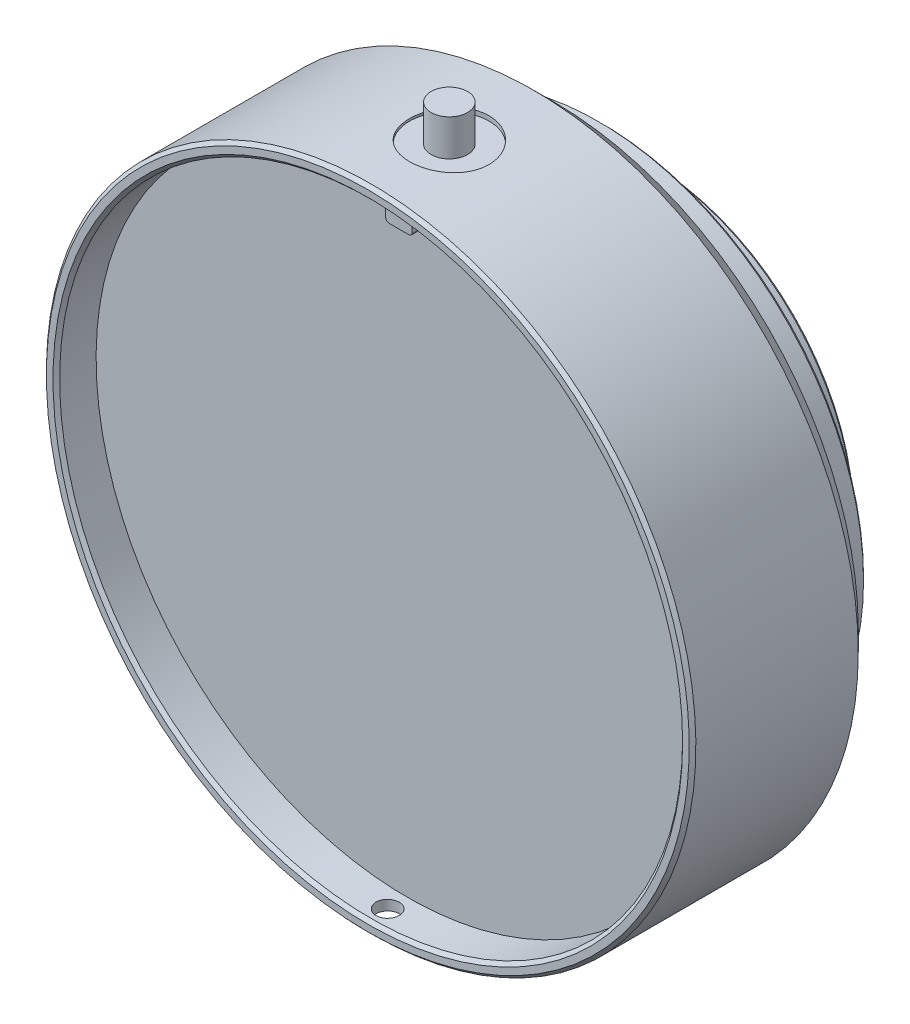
ISO-10303-21;
HEADER;
FILE_DESCRIPTION(('STEP AP214'),'2;1');
FILE_NAME('part.step','',(''),(''),'','','');
FILE_SCHEMA(('AUTOMOTIVE_DESIGN { 1 0 10303 214 1 1 1 1 }'));
ENDSEC;
DATA;
#1=APPLICATION_CONTEXT('core data for automotive mechanical design processes');
#2=APPLICATION_PROTOCOL_DEFINITION('international standard','automotive_design',2000,#1);
#3=PRODUCT_CONTEXT('',#1,'mechanical');
#4=PRODUCT('Part','Part','',(#3));
#5=PRODUCT_RELATED_PRODUCT_CATEGORY('part','',(#4));
#6=PRODUCT_DEFINITION_FORMATION('','',#4);
#7=PRODUCT_DEFINITION_CONTEXT('part definition',#1,'design');
#8=PRODUCT_DEFINITION('design','',#6,#7);
#9=PRODUCT_DEFINITION_SHAPE('','',#8);
#10=(LENGTH_UNIT() NAMED_UNIT(*) SI_UNIT(.MILLI.,.METRE.));
#11=(NAMED_UNIT(*) PLANE_ANGLE_UNIT() SI_UNIT($,.RADIAN.));
#12=(NAMED_UNIT(*) SI_UNIT($,.STERADIAN.) SOLID_ANGLE_UNIT());
#13=UNCERTAINTY_MEASURE_WITH_UNIT(LENGTH_MEASURE(1.E-05),#10,'distance_accuracy_value','');
#14=(GEOMETRIC_REPRESENTATION_CONTEXT(3) GLOBAL_UNCERTAINTY_ASSIGNED_CONTEXT((#13)) GLOBAL_UNIT_ASSIGNED_CONTEXT((#10,
#11,#12)) REPRESENTATION_CONTEXT('',''));
#15=CARTESIAN_POINT('',(0.,0.,0.));
#16=DIRECTION('',(0.,0.,1.));
#17=DIRECTION('',(1.,0.,0.));
#18=AXIS2_PLACEMENT_3D('',#15,#16,#17);
#19=CARTESIAN_POINT('',(0.,0.,36.3));
#20=DIRECTION('',(0.,0.,1.));
#21=DIRECTION('',(1.,0.,0.));
#22=AXIS2_PLACEMENT_3D('',#19,#20,#21);
#23=PLANE('',#22);
#24=DIRECTION('',(0.,-1.,0.));
#25=VECTOR('',#24,1.);
#26=CARTESIAN_POINT('',(-2.,47.,36.3));
#27=LINE('',#26,#25);
#28=CARTESIAN_POINT('',(-2.,44.82186966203,36.3));
#29=VERTEX_POINT('',#28);
#30=CARTESIAN_POINT('',(-2.,41.5,36.3));
#31=VERTEX_POINT('',#30);
#32=EDGE_CURVE('E216',#29,#31,#27,.T.);
#33=ORIENTED_EDGE('',*,*,#32,.F.);
#34=CARTESIAN_POINT('',(-4.,44.82186966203,36.3));
#35=DIRECTION('',(0.,0.,1.));
#36=DIRECTION('',(1.,0.,0.));
#37=AXIS2_PLACEMENT_3D('',#34,#35,#36);
#38=CIRCLE('',#37,2.);
#39=CARTESIAN_POINT('',(-4.17777777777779,46.8139527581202,36.3));
#40=VERTEX_POINT('',#39);
#41=EDGE_CURVE('E10',#29,#40,#38,.T.);
#42=ORIENTED_EDGE('',*,*,#41,.T.);
#43=CARTESIAN_POINT('',(0.,0.,36.3));
#44=DIRECTION('',(0.,0.,1.));
#45=DIRECTION('',(1.,0.,0.));
#46=AXIS2_PLACEMENT_3D('',#43,#44,#45);
#47=CIRCLE('',#46,47.);
#48=CARTESIAN_POINT('',(4.17777777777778,46.8139527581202,36.3));
#49=VERTEX_POINT('',#48);
#50=EDGE_CURVE('E1839',#40,#49,#47,.T.);
#51=ORIENTED_EDGE('',*,*,#50,.T.);
#52=CARTESIAN_POINT('',(4.,44.82186966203,36.3));
#53=DIRECTION('',(0.,0.,1.));
#54=DIRECTION('',(1.,0.,0.));
#55=AXIS2_PLACEMENT_3D('',#52,#53,#54);
#56=CIRCLE('',#55,2.);
#57=CARTESIAN_POINT('',(2.,44.82186966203,36.3));
#58=VERTEX_POINT('',#57);
#59=EDGE_CURVE('E186',#49,#58,#56,.T.);
#60=ORIENTED_EDGE('',*,*,#59,.T.);
#61=DIRECTION('',(0.,1.,0.));
#62=VECTOR('',#61,1.);
#63=CARTESIAN_POINT('',(2.,47.,36.3));
#64=LINE('',#63,#62);
#65=CARTESIAN_POINT('',(2.,41.5,36.3));
#66=VERTEX_POINT('',#65);
#67=EDGE_CURVE('E183',#66,#58,#64,.T.);
#68=ORIENTED_EDGE('',*,*,#67,.F.);
#69=CARTESIAN_POINT('',(1.5,41.5,36.3));
#70=DIRECTION('',(0.,0.,-1.));
#71=DIRECTION('',(1.,0.,0.));
#72=AXIS2_PLACEMENT_3D('',#69,#70,#71);
#73=CIRCLE('',#72,0.5);
#74=CARTESIAN_POINT('',(1.5,41.,36.3));
#75=VERTEX_POINT('',#74);
#76=EDGE_CURVE('E168',#66,#75,#73,.T.);
#77=ORIENTED_EDGE('',*,*,#76,.T.);
#78=DIRECTION('',(1.,0.,0.));
#79=VECTOR('',#78,1.);
#80=CARTESIAN_POINT('',(-2.,41.,36.3));
#81=LINE('',#80,#79);
#82=CARTESIAN_POINT('',(-1.5,41.,36.3));
#83=VERTEX_POINT('',#82);
#84=EDGE_CURVE('E180',#83,#75,#81,.T.);
#85=ORIENTED_EDGE('',*,*,#84,.F.);
#86=CARTESIAN_POINT('',(-1.5,41.5,36.3));
#87=DIRECTION('',(0.,0.,-1.));
#88=DIRECTION('',(1.,0.,0.));
#89=AXIS2_PLACEMENT_3D('',#86,#87,#88);
#90=CIRCLE('',#89,0.5);
#91=EDGE_CURVE('E32',#83,#31,#90,.T.);
#92=ORIENTED_EDGE('',*,*,#91,.T.);
#93=EDGE_LOOP('',(#33,#42,#51,#60,#68,#77,#85,#92));
#94=FACE_BOUND('',#93,.T.);
#95=ADVANCED_FACE('F16',(#94),#23,.T.);
#96=CARTESIAN_POINT('',(-4.,44.82186966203,36.3));
#97=DIRECTION('',(0.,0.,1.));
#98=DIRECTION('',(1.,0.,0.));
#99=AXIS2_PLACEMENT_3D('',#96,#97,#98);
#100=CYLINDRICAL_SURFACE('',#99,2.);
#101=CARTESIAN_POINT('',(-4.,44.82186966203,37.6));
#102=DIRECTION('',(0.,0.,-1.));
#103=DIRECTION('',(1.,0.,0.));
#104=AXIS2_PLACEMENT_3D('',#101,#102,#103);
#105=CIRCLE('',#104,2.);
#106=CARTESIAN_POINT('',(-4.17777777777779,46.8139527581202,37.6));
#107=VERTEX_POINT('',#106);
#108=CARTESIAN_POINT('',(-2.,44.82186966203,37.6));
#109=VERTEX_POINT('',#108);
#110=EDGE_CURVE('E47',#107,#109,#105,.T.);
#111=ORIENTED_EDGE('',*,*,#110,.F.);
#112=DIRECTION('',(0.,0.,1.));
#113=VECTOR('',#112,1.);
#114=CARTESIAN_POINT('',(-4.17777777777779,46.8139527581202,36.3));
#115=LINE('',#114,#113);
#116=EDGE_CURVE('E360',#40,#107,#115,.T.);
#117=ORIENTED_EDGE('',*,*,#116,.F.);
#118=ORIENTED_EDGE('',*,*,#41,.F.);
#119=DIRECTION('',(0.,0.,-1.));
#120=VECTOR('',#119,1.);
#121=CARTESIAN_POINT('',(-2.,44.82186966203,36.3));
#122=LINE('',#121,#120);
#123=EDGE_CURVE('E220',#109,#29,#122,.T.);
#124=ORIENTED_EDGE('',*,*,#123,.F.);
#125=EDGE_LOOP('',(#111,#117,#118,#124));
#126=FACE_BOUND('',#125,.T.);
#127=ADVANCED_FACE('F18',(#126),#100,.F.);
#128=CARTESIAN_POINT('',(-1.5,41.5,37.6));
#129=DIRECTION('',(0.,0.,-1.));
#130=DIRECTION('',(-1.,0.,0.));
#131=AXIS2_PLACEMENT_3D('',#128,#129,#130);
#132=CYLINDRICAL_SURFACE('',#131,0.5);
#133=CARTESIAN_POINT('',(-1.5,41.5,37.6));
#134=DIRECTION('',(0.,0.,1.));
#135=DIRECTION('',(1.,0.,0.));
#136=AXIS2_PLACEMENT_3D('',#133,#134,#135);
#137=CIRCLE('',#136,0.5);
#138=CARTESIAN_POINT('',(-2.,41.5,37.6));
#139=VERTEX_POINT('',#138);
#140=CARTESIAN_POINT('',(-1.5,41.,37.6));
#141=VERTEX_POINT('',#140);
#142=EDGE_CURVE('E225',#139,#141,#137,.T.);
#143=ORIENTED_EDGE('',*,*,#142,.F.);
#144=DIRECTION('',(0.,0.,1.));
#145=VECTOR('',#144,1.);
#146=CARTESIAN_POINT('',(-2.,41.5,37.6));
#147=LINE('',#146,#145);
#148=EDGE_CURVE('E221',#31,#139,#147,.T.);
#149=ORIENTED_EDGE('',*,*,#148,.F.);
#150=ORIENTED_EDGE('',*,*,#91,.F.);
#151=DIRECTION('',(0.,0.,-1.));
#152=VECTOR('',#151,1.);
#153=CARTESIAN_POINT('',(-1.5,41.,37.6));
#154=LINE('',#153,#152);
#155=EDGE_CURVE('E212',#141,#83,#154,.T.);
#156=ORIENTED_EDGE('',*,*,#155,.F.);
#157=EDGE_LOOP('',(#143,#149,#150,#156));
#158=FACE_BOUND('',#157,.T.);
#159=ADVANCED_FACE('F970',(#158),#132,.T.);
#160=CARTESIAN_POINT('',(0.,0.,37.6));
#161=DIRECTION('',(0.,0.,1.));
#162=DIRECTION('',(1.,0.,0.));
#163=AXIS2_PLACEMENT_3D('',#160,#161,#162);
#164=PLANE('',#163);
#165=DIRECTION('',(1.,0.,0.));
#166=VECTOR('',#165,1.);
#167=CARTESIAN_POINT('',(-2.,41.,37.6));
#168=LINE('',#167,#166);
#169=CARTESIAN_POINT('',(1.5,41.,37.6));
#170=VERTEX_POINT('',#169);
#171=EDGE_CURVE('E209',#141,#170,#168,.T.);
#172=ORIENTED_EDGE('',*,*,#171,.T.);
#173=CARTESIAN_POINT('',(1.5,41.5,37.6));
#174=DIRECTION('',(0.,0.,1.));
#175=DIRECTION('',(1.,0.,0.));
#176=AXIS2_PLACEMENT_3D('',#173,#174,#175);
#177=CIRCLE('',#176,0.5);
#178=CARTESIAN_POINT('',(2.,41.5,37.6));
#179=VERTEX_POINT('',#178);
#180=EDGE_CURVE('E191',#170,#179,#177,.T.);
#181=ORIENTED_EDGE('',*,*,#180,.T.);
#182=DIRECTION('',(0.,1.,0.));
#183=VECTOR('',#182,1.);
#184=CARTESIAN_POINT('',(2.,47.,37.6));
#185=LINE('',#184,#183);
#186=CARTESIAN_POINT('',(2.,44.82186966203,37.6));
#187=VERTEX_POINT('',#186);
#188=EDGE_CURVE('E194',#179,#187,#185,.T.);
#189=ORIENTED_EDGE('',*,*,#188,.T.);
#190=CARTESIAN_POINT('',(4.,44.82186966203,37.6));
#191=DIRECTION('',(0.,0.,-1.));
#192=DIRECTION('',(1.,0.,0.));
#193=AXIS2_PLACEMENT_3D('',#190,#191,#192);
#194=CIRCLE('',#193,2.);
#195=CARTESIAN_POINT('',(4.17777777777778,46.8139527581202,37.6));
#196=VERTEX_POINT('',#195);
#197=EDGE_CURVE('E378',#187,#196,#194,.T.);
#198=ORIENTED_EDGE('',*,*,#197,.T.);
#199=CARTESIAN_POINT('',(0.,0.,37.6));
#200=DIRECTION('',(0.,0.,-1.));
#201=DIRECTION('',(1.,0.,0.));
#202=AXIS2_PLACEMENT_3D('',#199,#200,#201);
#203=CIRCLE('',#202,47.);
#204=EDGE_CURVE('E382',#107,#196,#203,.T.);
#205=ORIENTED_EDGE('',*,*,#204,.F.);
#206=ORIENTED_EDGE('',*,*,#110,.T.);
#207=DIRECTION('',(0.,-1.,0.));
#208=VECTOR('',#207,1.);
#209=CARTESIAN_POINT('',(-2.,47.,37.6));
#210=LINE('',#209,#208);
#211=EDGE_CURVE('E217',#109,#139,#210,.T.);
#212=ORIENTED_EDGE('',*,*,#211,.T.);
#213=ORIENTED_EDGE('',*,*,#142,.T.);
#214=EDGE_LOOP('',(#172,#181,#189,#198,#205,#206,#212,#213));
#215=FACE_BOUND('',#214,.T.);
#216=ADVANCED_FACE('F380',(#215),#164,.T.);
#217=CARTESIAN_POINT('',(-2.,47.,37.6));
#218=DIRECTION('',(1.,0.,0.));
#219=DIRECTION('',(0.,-1.,0.));
#220=AXIS2_PLACEMENT_3D('',#217,#218,#219);
#221=PLANE('',#220);
#222=ORIENTED_EDGE('',*,*,#32,.T.);
#223=ORIENTED_EDGE('',*,*,#148,.T.);
#224=ORIENTED_EDGE('',*,*,#211,.F.);
#225=ORIENTED_EDGE('',*,*,#123,.T.);
#226=EDGE_LOOP('',(#222,#223,#224,#225));
#227=FACE_BOUND('',#226,.T.);
#228=ADVANCED_FACE('F969',(#227),#221,.F.);
#229=CARTESIAN_POINT('',(-2.,41.,37.6));
#230=DIRECTION('',(0.,1.,0.));
#231=DIRECTION('',(1.,0.,0.));
#232=AXIS2_PLACEMENT_3D('',#229,#230,#231);
#233=PLANE('',#232);
#234=ORIENTED_EDGE('',*,*,#84,.T.);
#235=DIRECTION('',(0.,0.,1.));
#236=VECTOR('',#235,1.);
#237=CARTESIAN_POINT('',(1.5,41.,37.6));
#238=LINE('',#237,#236);
#239=EDGE_CURVE('E176',#75,#170,#238,.T.);
#240=ORIENTED_EDGE('',*,*,#239,.T.);
#241=ORIENTED_EDGE('',*,*,#171,.F.);
#242=ORIENTED_EDGE('',*,*,#155,.T.);
#243=EDGE_LOOP('',(#234,#240,#241,#242));
#244=FACE_BOUND('',#243,.T.);
#245=ADVANCED_FACE('F1338',(#244),#233,.F.);
#246=CARTESIAN_POINT('',(1.5,41.5,37.6));
#247=DIRECTION('',(0.,0.,-1.));
#248=DIRECTION('',(-1.,0.,0.));
#249=AXIS2_PLACEMENT_3D('',#246,#247,#248);
#250=CYLINDRICAL_SURFACE('',#249,0.5);
#251=ORIENTED_EDGE('',*,*,#180,.F.);
#252=ORIENTED_EDGE('',*,*,#239,.F.);
#253=ORIENTED_EDGE('',*,*,#76,.F.);
#254=DIRECTION('',(0.,0.,-1.));
#255=VECTOR('',#254,1.);
#256=CARTESIAN_POINT('',(2.,41.5,37.6));
#257=LINE('',#256,#255);
#258=EDGE_CURVE('E173',#179,#66,#257,.T.);
#259=ORIENTED_EDGE('',*,*,#258,.F.);
#260=EDGE_LOOP('',(#251,#252,#253,#259));
#261=FACE_BOUND('',#260,.T.);
#262=ADVANCED_FACE('F171',(#261),#250,.T.);
#263=CARTESIAN_POINT('',(2.,47.,37.6));
#264=DIRECTION('',(-1.,0.,0.));
#265=DIRECTION('',(0.,0.,1.));
#266=AXIS2_PLACEMENT_3D('',#263,#264,#265);
#267=PLANE('',#266);
#268=ORIENTED_EDGE('',*,*,#188,.F.);
#269=ORIENTED_EDGE('',*,*,#258,.T.);
#270=ORIENTED_EDGE('',*,*,#67,.T.);
#271=DIRECTION('',(0.,0.,1.));
#272=VECTOR('',#271,1.);
#273=CARTESIAN_POINT('',(2.,44.82186966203,37.6));
#274=LINE('',#273,#272);
#275=EDGE_CURVE('E201',#58,#187,#274,.T.);
#276=ORIENTED_EDGE('',*,*,#275,.T.);
#277=EDGE_LOOP('',(#268,#269,#270,#276));
#278=FACE_BOUND('',#277,.T.);
#279=ADVANCED_FACE('F193',(#278),#267,.F.);
#280=CARTESIAN_POINT('',(4.,44.82186966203,36.3));
#281=DIRECTION('',(0.,0.,1.));
#282=DIRECTION('',(1.,0.,0.));
#283=AXIS2_PLACEMENT_3D('',#280,#281,#282);
#284=CYLINDRICAL_SURFACE('',#283,2.);
#285=ORIENTED_EDGE('',*,*,#59,.F.);
#286=DIRECTION('',(0.,0.,-1.));
#287=VECTOR('',#286,1.);
#288=CARTESIAN_POINT('',(4.17777777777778,46.8139527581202,36.3));
#289=LINE('',#288,#287);
#290=EDGE_CURVE('E388',#196,#49,#289,.T.);
#291=ORIENTED_EDGE('',*,*,#290,.F.);
#292=ORIENTED_EDGE('',*,*,#197,.F.);
#293=ORIENTED_EDGE('',*,*,#275,.F.);
#294=EDGE_LOOP('',(#285,#291,#292,#293));
#295=FACE_BOUND('',#294,.T.);
#296=ADVANCED_FACE('F389',(#295),#284,.F.);
#297=CARTESIAN_POINT('',(0.,-48.5,45.3));
#298=DIRECTION('',(0.,-1.,0.));
#299=DIRECTION('',(0.,0.,-1.));
#300=AXIS2_PLACEMENT_3D('',#297,#298,#299);
#301=PLANE('',#300);
#302=CARTESIAN_POINT('',(0.,-48.5,39.3));
#303=DIRECTION('',(0.,-1.,0.));
#304=DIRECTION('',(0.,0.,-1.));
#305=AXIS2_PLACEMENT_3D('',#302,#303,#304);
#306=CIRCLE('',#305,1.75);
#307=CARTESIAN_POINT('',(0.,-48.5,37.55));
#308=VERTEX_POINT('',#307);
#309=EDGE_CURVE('E1817',#308,#308,#306,.T.);
#310=ORIENTED_EDGE('',*,*,#309,.F.);
#311=EDGE_LOOP('',(#310));
#312=FACE_BOUND('',#311,.T.);
#313=DIRECTION('',(0.,0.,-1.));
#314=VECTOR('',#313,1.);
#315=CARTESIAN_POINT('',(-3.5,-48.5,45.3));
#316=LINE('',#315,#314);
#317=CARTESIAN_POINT('',(-3.5,-48.5,42.1738753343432));
#318=VERTEX_POINT('',#317);
#319=CARTESIAN_POINT('',(-3.5,-48.5,39.3));
#320=VERTEX_POINT('',#319);
#321=EDGE_CURVE('E233',#318,#320,#316,.T.);
#322=ORIENTED_EDGE('',*,*,#321,.T.);
#323=CARTESIAN_POINT('',(0.,-48.5,39.3));
#324=DIRECTION('',(0.,-1.,0.));
#325=DIRECTION('',(0.,0.,-1.));
#326=AXIS2_PLACEMENT_3D('',#323,#324,#325);
#327=CIRCLE('',#326,3.5);
#328=CARTESIAN_POINT('',(3.5,-48.5,39.3));
#329=VERTEX_POINT('',#328);
#330=EDGE_CURVE('E345',#320,#329,#327,.T.);
#331=ORIENTED_EDGE('',*,*,#330,.T.);
#332=DIRECTION('',(0.,0.,1.));
#333=VECTOR('',#332,1.);
#334=CARTESIAN_POINT('',(3.5,-48.5,45.3));
#335=LINE('',#334,#333);
#336=CARTESIAN_POINT('',(3.5,-48.5,42.1738753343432));
#337=VERTEX_POINT('',#336);
#338=EDGE_CURVE('E234',#329,#337,#335,.T.);
#339=ORIENTED_EDGE('',*,*,#338,.T.);
#340=CARTESIAN_POINT('',(0.,-48.5,42.3));
#341=CARTESIAN_POINT('',(1.16987651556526,-48.5,42.3));
#342=CARTESIAN_POINT('',(2.33651735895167,-48.5,42.2576202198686));
#343=CARTESIAN_POINT('',(3.5,-48.5,42.1738753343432));
#344=B_SPLINE_CURVE_WITH_KNOTS('',3,(#340,#341,#342,#343),.UNSPECIFIED.,.F.,.F.,(4,4),
(0.0154102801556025,0.018912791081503),.UNSPECIFIED.);
#345=CARTESIAN_POINT('',(0.,-48.5,42.3));
#346=VERTEX_POINT('',#345);
#347=EDGE_CURVE('E238',#346,#337,#344,.T.);
#348=ORIENTED_EDGE('',*,*,#347,.F.);
#349=CARTESIAN_POINT('',(-3.5,-48.5,42.1738753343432));
#350=CARTESIAN_POINT('',(-2.91736474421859,-48.5,42.2158121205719));
#351=CARTESIAN_POINT('',(-2.33222249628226,-48.5,42.2474609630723));
#352=CARTESIAN_POINT('',(-1.16490582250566,-48.5,42.2895187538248));
#353=CARTESIAN_POINT('',(-0.582052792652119,-48.5,42.3));
#354=CARTESIAN_POINT('',(0.,-48.5,42.3));
#355=B_SPLINE_CURVE_WITH_KNOTS('',3,(#349,#350,#351,#352,#353,#354),.UNSPECIFIED.,.F.,.F.,(4,2,
4),(0.0119250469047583,0.0136676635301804,0.0154102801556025),.UNSPECIFIED.);
#356=EDGE_CURVE('E257',#318,#346,#355,.T.);
#357=ORIENTED_EDGE('',*,*,#356,.F.);
#358=EDGE_LOOP('',(#322,#331,#339,#348,#357));
#359=FACE_BOUND('',#358,.T.);
#360=ADVANCED_FACE('F355',(#312,#359),#301,.T.);
#361=CARTESIAN_POINT('',(0.,0.,42.3));
#362=DIRECTION('',(0.,0.,1.));
#363=DIRECTION('',(1.,0.,0.));
#364=AXIS2_PLACEMENT_3D('',#361,#362,#363);
#365=PLANE('',#364);
#366=CARTESIAN_POINT('',(0.,0.,42.3));
#367=DIRECTION('',(0.,0.,-1.));
#368=DIRECTION('',(1.,0.,0.));
#369=AXIS2_PLACEMENT_3D('',#366,#367,#368);
#370=CIRCLE('',#369,47.5);
#371=CARTESIAN_POINT('',(47.5,0.,42.3));
#372=VERTEX_POINT('',#371);
#373=EDGE_CURVE('E352',#372,#372,#370,.T.);
#374=ORIENTED_EDGE('',*,*,#373,.T.);
#375=EDGE_LOOP('',(#374));
#376=FACE_BOUND('',#375,.T.);
#377=CARTESIAN_POINT('',(0.,0.,42.3));
#378=DIRECTION('',(0.,0.,1.));
#379=DIRECTION('',(1.,0.,0.));
#380=AXIS2_PLACEMENT_3D('',#377,#378,#379);
#381=CIRCLE('',#380,48.5);
#382=EDGE_CURVE('E247',#346,#346,#381,.T.);
#383=ORIENTED_EDGE('',*,*,#382,.T.);
#384=EDGE_LOOP('',(#383));
#385=FACE_BOUND('',#384,.T.);
#386=ADVANCED_FACE('F1306',(#376,#385),#365,.T.);
#387=CARTESIAN_POINT('',(-3.5,-48.5,45.3));
#388=DIRECTION('',(-1.,0.,0.));
#389=DIRECTION('',(0.,0.,1.));
#390=AXIS2_PLACEMENT_3D('',#387,#388,#389);
#391=PLANE('',#390);
#392=DIRECTION('',(0.,-1.,0.));
#393=VECTOR('',#392,1.);
#394=CARTESIAN_POINT('',(-3.5,-48.5,39.3));
#395=LINE('',#394,#393);
#396=CARTESIAN_POINT('',(-3.5,-48.8748401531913,39.3));
#397=VERTEX_POINT('',#396);
#398=EDGE_CURVE('E230',#320,#397,#395,.T.);
#399=ORIENTED_EDGE('',*,*,#398,.F.);
#400=ORIENTED_EDGE('',*,*,#321,.F.);
#401=DIRECTION('',(0.,-0.708024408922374,-0.706187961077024));
#402=VECTOR('',#401,1.);
#403=CARTESIAN_POINT('',(-3.5,-48.6874210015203,41.9869385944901));
#404=LINE('',#403,#402);
#405=CARTESIAN_POINT('',(-3.5,-48.8748401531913,41.8));
#406=VERTEX_POINT('',#405);
#407=EDGE_CURVE('E267',#318,#406,#404,.T.);
#408=ORIENTED_EDGE('',*,*,#407,.T.);
#409=DIRECTION('',(0.,0.,1.));
#410=VECTOR('',#409,1.);
#411=CARTESIAN_POINT('',(-3.5,-48.8748401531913,42.3));
#412=LINE('',#411,#410);
#413=EDGE_CURVE('E235',#397,#406,#412,.T.);
#414=ORIENTED_EDGE('',*,*,#413,.F.);
#415=EDGE_LOOP('',(#399,#400,#408,#414));
#416=FACE_BOUND('',#415,.T.);
#417=ADVANCED_FACE('F362',(#416),#391,.F.);
#418=CARTESIAN_POINT('',(3.5,-48.5,45.3));
#419=DIRECTION('',(1.,0.,0.));
#420=DIRECTION('',(0.,1.,0.));
#421=AXIS2_PLACEMENT_3D('',#418,#419,#420);
#422=PLANE('',#421);
#423=DIRECTION('',(0.,0.708010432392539,0.706201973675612));
#424=VECTOR('',#423,1.);
#425=CARTESIAN_POINT('',(3.5,-48.6874210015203,41.9869385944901));
#426=LINE('',#425,#424);
#427=CARTESIAN_POINT('',(3.5,-48.8748401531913,41.8));
#428=VERTEX_POINT('',#427);
#429=EDGE_CURVE('E248',#428,#337,#426,.T.);
#430=ORIENTED_EDGE('',*,*,#429,.T.);
#431=ORIENTED_EDGE('',*,*,#338,.F.);
#432=DIRECTION('',(0.,-1.,0.));
#433=VECTOR('',#432,1.);
#434=CARTESIAN_POINT('',(3.5,-48.5,39.3));
#435=LINE('',#434,#433);
#436=CARTESIAN_POINT('',(3.5,-48.8748401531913,39.3));
#437=VERTEX_POINT('',#436);
#438=EDGE_CURVE('E243',#329,#437,#435,.T.);
#439=ORIENTED_EDGE('',*,*,#438,.T.);
#440=DIRECTION('',(0.,0.,-1.));
#441=VECTOR('',#440,1.);
#442=CARTESIAN_POINT('',(3.5,-48.8748401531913,42.3));
#443=LINE('',#442,#441);
#444=EDGE_CURVE('E239',#428,#437,#443,.T.);
#445=ORIENTED_EDGE('',*,*,#444,.F.);
#446=EDGE_LOOP('',(#430,#431,#439,#445));
#447=FACE_BOUND('',#446,.T.);
#448=ADVANCED_FACE('F1330',(#447),#422,.F.);
#449=CARTESIAN_POINT('',(0.,48.3,30.));
#450=DIRECTION('',(0.,1.,0.));
#451=DIRECTION('',(1.,0.,0.));
#452=AXIS2_PLACEMENT_3D('',#449,#450,#451);
#453=PLANE('',#452);
#454=CARTESIAN_POINT('',(0.,48.3,30.));
#455=DIRECTION('',(0.,1.,0.));
#456=DIRECTION('',(0.,0.,1.));
#457=AXIS2_PLACEMENT_3D('',#454,#455,#456);
#458=CIRCLE('',#457,2.75);
#459=CARTESIAN_POINT('',(0.,48.3,32.75));
#460=VERTEX_POINT('',#459);
#461=EDGE_CURVE('E487',#460,#460,#458,.T.);
#462=ORIENTED_EDGE('',*,*,#461,.F.);
#463=EDGE_LOOP('',(#462));
#464=FACE_BOUND('',#463,.T.);
#465=CARTESIAN_POINT('',(0.,48.3,30.));
#466=DIRECTION('',(0.,1.,0.));
#467=DIRECTION('',(0.,0.,1.));
#468=AXIS2_PLACEMENT_3D('',#465,#466,#467);
#469=CIRCLE('',#468,6.);
#470=CARTESIAN_POINT('',(0.,48.3,36.));
#471=VERTEX_POINT('',#470);
#472=EDGE_CURVE('E282',#471,#471,#469,.T.);
#473=ORIENTED_EDGE('',*,*,#472,.T.);
#474=EDGE_LOOP('',(#473));
#475=FACE_BOUND('',#474,.T.);
#476=ADVANCED_FACE('F1387',(#464,#475),#453,.T.);
#477=CARTESIAN_POINT('',(0.,0.,14.3));
#478=DIRECTION('',(0.,0.,1.));
#479=DIRECTION('',(1.,0.,0.));
#480=AXIS2_PLACEMENT_3D('',#477,#478,#479);
#481=PLANE('',#480);
#482=CARTESIAN_POINT('',(0.,0.,14.3));
#483=DIRECTION('',(0.,0.,1.));
#484=DIRECTION('',(1.,0.,0.));
#485=AXIS2_PLACEMENT_3D('',#482,#483,#484);
#486=CIRCLE('',#485,40.5);
#487=CARTESIAN_POINT('',(40.5,0.,14.3));
#488=VERTEX_POINT('',#487);
#489=EDGE_CURVE('E497',#488,#488,#486,.T.);
#490=ORIENTED_EDGE('',*,*,#489,.T.);
#491=EDGE_LOOP('',(#490));
#492=FACE_BOUND('',#491,.T.);
#493=CARTESIAN_POINT('',(0.,0.,14.3));
#494=DIRECTION('',(0.,0.,-1.));
#495=DIRECTION('',(1.,0.,0.));
#496=AXIS2_PLACEMENT_3D('',#493,#494,#495);
#497=CIRCLE('',#496,46.);
#498=CARTESIAN_POINT('',(46.,0.,14.3));
#499=VERTEX_POINT('',#498);
#500=EDGE_CURVE('E467',#499,#499,#497,.T.);
#501=ORIENTED_EDGE('',*,*,#500,.T.);
#502=EDGE_LOOP('',(#501));
#503=FACE_BOUND('',#502,.T.);
#504=ADVANCED_FACE('F1375',(#492,#503),#481,.F.);
#505=CARTESIAN_POINT('',(0.,53.8,30.));
#506=DIRECTION('',(0.,1.,0.));
#507=DIRECTION('',(1.,0.,0.));
#508=AXIS2_PLACEMENT_3D('',#505,#506,#507);
#509=PLANE('',#508);
#510=CARTESIAN_POINT('',(0.,53.8,30.));
#511=DIRECTION('',(0.,1.,0.));
#512=DIRECTION('',(0.,0.,1.));
#513=AXIS2_PLACEMENT_3D('',#510,#511,#512);
#514=CIRCLE('',#513,2.75);
#515=CARTESIAN_POINT('',(0.,53.8,32.75));
#516=VERTEX_POINT('',#515);
#517=EDGE_CURVE('E477',#516,#516,#514,.T.);
#518=ORIENTED_EDGE('',*,*,#517,.T.);
#519=EDGE_LOOP('',(#518));
#520=FACE_BOUND('',#519,.T.);
#521=ADVANCED_FACE('F1363',(#520),#509,.T.);
#522=CARTESIAN_POINT('',(0.,0.,7.));
#523=DIRECTION('',(0.,0.,-1.));
#524=DIRECTION('',(0.,-1.,0.));
#525=AXIS2_PLACEMENT_3D('',#522,#523,#524);
#526=PLANE('',#525);
#527=CARTESIAN_POINT('',(0.,0.,7.));
#528=DIRECTION('',(0.,0.,-1.));
#529=DIRECTION('',(-1.,0.,0.));
#530=AXIS2_PLACEMENT_3D('',#527,#528,#529);
#531=CIRCLE('',#530,31.5);
#532=CARTESIAN_POINT('',(-31.5,0.,7.));
#533=VERTEX_POINT('',#532);
#534=EDGE_CURVE('E551',#533,#533,#531,.T.);
#535=ORIENTED_EDGE('',*,*,#534,.F.);
#536=EDGE_LOOP('',(#535));
#537=FACE_BOUND('',#536,.T.);
#538=CARTESIAN_POINT('',(0.,0.,7.));
#539=DIRECTION('',(0.,0.,-1.));
#540=DIRECTION('',(-1.,0.,0.));
#541=AXIS2_PLACEMENT_3D('',#538,#539,#540);
#542=CIRCLE('',#541,39.5);
#543=CARTESIAN_POINT('',(-39.5,0.,7.));
#544=VERTEX_POINT('',#543);
#545=EDGE_CURVE('E541',#544,#544,#542,.T.);
#546=ORIENTED_EDGE('',*,*,#545,.T.);
#547=EDGE_LOOP('',(#546));
#548=FACE_BOUND('',#547,.T.);
#549=ADVANCED_FACE('F1318',(#537,#548),#526,.T.);
#550=CARTESIAN_POINT('',(0.,0.,0.));
#551=DIRECTION('',(0.,0.,1.));
#552=DIRECTION('',(1.,0.,0.));
#553=AXIS2_PLACEMENT_3D('',#550,#551,#552);
#554=PLANE('',#553);
#555=CARTESIAN_POINT('',(0.,0.,0.));
#556=DIRECTION('',(0.,0.,1.));
#557=DIRECTION('',(1.,0.,0.));
#558=AXIS2_PLACEMENT_3D('',#555,#556,#557);
#559=CIRCLE('',#558,16.25);
#560=CARTESIAN_POINT('',(16.25,0.,0.));
#561=VERTEX_POINT('',#560);
#562=EDGE_CURVE('E450',#561,#561,#559,.T.);
#563=ORIENTED_EDGE('',*,*,#562,.T.);
#564=EDGE_LOOP('',(#563));
#565=FACE_BOUND('',#564,.T.);
#566=CARTESIAN_POINT('',(-12.5,21.650635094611,0.));
#567=DIRECTION('',(0.,0.,-1.));
#568=DIRECTION('',(-1.,0.,0.));
#569=AXIS2_PLACEMENT_3D('',#566,#567,#568);
#570=CIRCLE('',#569,3.2);
#571=CARTESIAN_POINT('',(-15.7,21.650635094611,0.));
#572=VERTEX_POINT('',#571);
#573=EDGE_CURVE('E509',#572,#572,#570,.T.);
#574=ORIENTED_EDGE('',*,*,#573,.F.);
#575=EDGE_LOOP('',(#574));
#576=FACE_BOUND('',#575,.T.);
#577=CARTESIAN_POINT('',(12.5,21.650635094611,0.));
#578=DIRECTION('',(0.,0.,-1.));
#579=DIRECTION('',(-1.,0.,0.));
#580=AXIS2_PLACEMENT_3D('',#577,#578,#579);
#581=CIRCLE('',#580,3.2);
#582=CARTESIAN_POINT('',(9.3,21.650635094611,0.));
#583=VERTEX_POINT('',#582);
#584=EDGE_CURVE('E510',#583,#583,#581,.T.);
#585=ORIENTED_EDGE('',*,*,#584,.F.);
#586=EDGE_LOOP('',(#585));
#587=FACE_BOUND('',#586,.T.);
#588=CARTESIAN_POINT('',(25.,0.,0.));
#589=DIRECTION('',(0.,0.,-1.));
#590=DIRECTION('',(-1.,0.,0.));
#591=AXIS2_PLACEMENT_3D('',#588,#589,#590);
#592=CIRCLE('',#591,3.2);
#593=CARTESIAN_POINT('',(21.8,0.,0.));
#594=VERTEX_POINT('',#593);
#595=EDGE_CURVE('E563',#594,#594,#592,.T.);
#596=ORIENTED_EDGE('',*,*,#595,.F.);
#597=EDGE_LOOP('',(#596));
#598=FACE_BOUND('',#597,.T.);
#599=CARTESIAN_POINT('',(12.5,-21.650635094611,0.));
#600=DIRECTION('',(0.,0.,-1.));
#601=DIRECTION('',(-1.,0.,0.));
#602=AXIS2_PLACEMENT_3D('',#599,#600,#601);
#603=CIRCLE('',#602,3.2);
#604=CARTESIAN_POINT('',(9.3,-21.650635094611,0.));
#605=VERTEX_POINT('',#604);
#606=EDGE_CURVE('E564',#605,#605,#603,.T.);
#607=ORIENTED_EDGE('',*,*,#606,.F.);
#608=EDGE_LOOP('',(#607));
#609=FACE_BOUND('',#608,.T.);
#610=CARTESIAN_POINT('',(-12.5000000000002,-21.6506350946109,0.));
#611=DIRECTION('',(0.,0.,-1.));
#612=DIRECTION('',(-1.,0.,0.));
#613=AXIS2_PLACEMENT_3D('',#610,#611,#612);
#614=CIRCLE('',#613,3.2);
#615=CARTESIAN_POINT('',(-15.7000000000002,-21.6506350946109,0.));
#616=VERTEX_POINT('',#615);
#617=EDGE_CURVE('E654',#616,#616,#614,.T.);
#618=ORIENTED_EDGE('',*,*,#617,.F.);
#619=EDGE_LOOP('',(#618));
#620=FACE_BOUND('',#619,.T.);
#621=CARTESIAN_POINT('',(-25.,2.63677968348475E-13,0.));
#622=DIRECTION('',(0.,0.,-1.));
#623=DIRECTION('',(-1.,0.,0.));
#624=AXIS2_PLACEMENT_3D('',#621,#622,#623);
#625=CIRCLE('',#624,3.2);
#626=CARTESIAN_POINT('',(-28.2,2.63677968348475E-13,0.));
#627=VERTEX_POINT('',#626);
#628=EDGE_CURVE('E571',#627,#627,#625,.T.);
#629=ORIENTED_EDGE('',*,*,#628,.F.);
#630=EDGE_LOOP('',(#629));
#631=FACE_BOUND('',#630,.T.);
#632=CARTESIAN_POINT('',(0.,25.,0.));
#633=DIRECTION('',(0.,0.,1.));
#634=DIRECTION('',(1.,0.,0.));
#635=AXIS2_PLACEMENT_3D('',#632,#633,#634);
#636=CIRCLE('',#635,3.50000000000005);
#637=CARTESIAN_POINT('',(3.50000000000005,25.,0.));
#638=VERTEX_POINT('',#637);
#639=EDGE_CURVE('E619',#638,#638,#636,.T.);
#640=ORIENTED_EDGE('',*,*,#639,.T.);
#641=EDGE_LOOP('',(#640));
#642=FACE_BOUND('',#641,.T.);
#643=CARTESIAN_POINT('',(0.,0.,0.));
#644=DIRECTION('',(0.,0.,-1.));
#645=DIRECTION('',(1.,0.,0.));
#646=AXIS2_PLACEMENT_3D('',#643,#644,#645);
#647=CIRCLE('',#646,31.);
#648=CARTESIAN_POINT('',(31.,0.,0.));
#649=VERTEX_POINT('',#648);
#650=EDGE_CURVE('E599',#649,#649,#647,.T.);
#651=ORIENTED_EDGE('',*,*,#650,.T.);
#652=EDGE_LOOP('',(#651));
#653=FACE_BOUND('',#652,.T.);
#654=ADVANCED_FACE('F1227',(#565,#576,#587,#598,#609,#620,#631,#642,#653),#554,.F.);
#655=CARTESIAN_POINT('',(0.,25.,6.));
#656=DIRECTION('',(0.,0.,-1.));
#657=DIRECTION('',(0.,-1.,0.));
#658=AXIS2_PLACEMENT_3D('',#655,#656,#657);
#659=PLANE('',#658);
#660=CARTESIAN_POINT('',(0.,25.,6.));
#661=DIRECTION('',(0.,0.,-1.));
#662=DIRECTION('',(-1.,0.,0.));
#663=AXIS2_PLACEMENT_3D('',#660,#661,#662);
#664=CIRCLE('',#663,3.);
#665=CARTESIAN_POINT('',(-3.,25.,6.));
#666=VERTEX_POINT('',#665);
#667=EDGE_CURVE('E443',#666,#666,#664,.T.);
#668=ORIENTED_EDGE('',*,*,#667,.T.);
#669=EDGE_LOOP('',(#668));
#670=FACE_BOUND('',#669,.T.);
#671=ADVANCED_FACE('F1223',(#670),#659,.T.);
#672=CARTESIAN_POINT('',(0.,0.,8.));
#673=DIRECTION('',(0.,0.,-1.));
#674=DIRECTION('',(0.,-1.,0.));
#675=AXIS2_PLACEMENT_3D('',#672,#673,#674);
#676=PLANE('',#675);
#677=CARTESIAN_POINT('',(0.,0.,8.));
#678=DIRECTION('',(0.,0.,-1.));
#679=DIRECTION('',(-1.,0.,0.));
#680=AXIS2_PLACEMENT_3D('',#677,#678,#679);
#681=CIRCLE('',#680,15.75);
#682=CARTESIAN_POINT('',(-15.75,0.,8.));
#683=VERTEX_POINT('',#682);
#684=EDGE_CURVE('E242',#683,#683,#681,.T.);
#685=ORIENTED_EDGE('',*,*,#684,.T.);
#686=EDGE_LOOP('',(#685));
#687=FACE_BOUND('',#686,.T.);
#688=ADVANCED_FACE('F1085',(#687),#676,.T.);
#689=CARTESIAN_POINT('',(-12.5,21.650635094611,11.));
#690=DIRECTION('',(0.,0.,-1.));
#691=DIRECTION('',(-1.,0.,0.));
#692=AXIS2_PLACEMENT_3D('',#689,#690,#691);
#693=CONICAL_SURFACE('',#692,2.5,1.02974425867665);
#694=CARTESIAN_POINT('',(-12.5,21.650635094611,11.));
#695=DIRECTION('',(0.,0.,-1.));
#696=DIRECTION('',(-1.,0.,0.));
#697=AXIS2_PLACEMENT_3D('',#694,#695,#696);
#698=CIRCLE('',#697,2.5);
#699=CARTESIAN_POINT('',(-15.,21.650635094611,11.));
#700=VERTEX_POINT('',#699);
#701=EDGE_CURVE('E739',#700,#700,#698,.T.);
#702=ORIENTED_EDGE('',*,*,#701,.T.);
#703=EDGE_LOOP('',(#702));
#704=FACE_BOUND('',#703,.T.);
#705=CARTESIAN_POINT('',(-12.5,21.650635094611,12.5021515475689));
#706=VERTEX_POINT('',#705);
#707=VERTEX_LOOP('',#706);
#708=FACE_BOUND('',#707,.T.);
#709=ADVANCED_FACE('F1081',(#704,#708),#693,.F.);
#710=CARTESIAN_POINT('',(12.5,21.650635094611,11.));
#711=DIRECTION('',(0.,0.,-1.));
#712=DIRECTION('',(-1.,0.,0.));
#713=AXIS2_PLACEMENT_3D('',#710,#711,#712);
#714=CONICAL_SURFACE('',#713,2.5,1.02974425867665);
#715=CARTESIAN_POINT('',(12.5,21.650635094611,11.));
#716=DIRECTION('',(0.,0.,-1.));
#717=DIRECTION('',(-1.,0.,0.));
#718=AXIS2_PLACEMENT_3D('',#715,#716,#717);
#719=CIRCLE('',#718,2.5);
#720=CARTESIAN_POINT('',(10.,21.650635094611,11.));
#721=VERTEX_POINT('',#720);
#722=EDGE_CURVE('E733',#721,#721,#719,.T.);
#723=ORIENTED_EDGE('',*,*,#722,.T.);
#724=EDGE_LOOP('',(#723));
#725=FACE_BOUND('',#724,.T.);
#726=CARTESIAN_POINT('',(12.5,21.650635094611,12.5021515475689));
#727=VERTEX_POINT('',#726);
#728=VERTEX_LOOP('',#727);
#729=FACE_BOUND('',#728,.T.);
#730=ADVANCED_FACE('F1050',(#725,#729),#714,.F.);
#731=CARTESIAN_POINT('',(25.,0.,11.));
#732=DIRECTION('',(0.,0.,-1.));
#733=DIRECTION('',(-1.,0.,0.));
#734=AXIS2_PLACEMENT_3D('',#731,#732,#733);
#735=CONICAL_SURFACE('',#734,2.5,1.02974425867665);
#736=CARTESIAN_POINT('',(25.,0.,11.));
#737=DIRECTION('',(0.,0.,-1.));
#738=DIRECTION('',(-1.,0.,0.));
#739=AXIS2_PLACEMENT_3D('',#736,#737,#738);
#740=CIRCLE('',#739,2.5);
#741=CARTESIAN_POINT('',(22.5,0.,11.));
#742=VERTEX_POINT('',#741);
#743=EDGE_CURVE('E740',#742,#742,#740,.T.);
#744=ORIENTED_EDGE('',*,*,#743,.T.);
#745=EDGE_LOOP('',(#744));
#746=FACE_BOUND('',#745,.T.);
#747=CARTESIAN_POINT('',(25.,0.,12.5021515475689));
#748=VERTEX_POINT('',#747);
#749=VERTEX_LOOP('',#748);
#750=FACE_BOUND('',#749,.T.);
#751=ADVANCED_FACE('F1045',(#746,#750),#735,.F.);
#752=CARTESIAN_POINT('',(12.5,-21.650635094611,11.));
#753=DIRECTION('',(0.,0.,-1.));
#754=DIRECTION('',(-1.,0.,0.));
#755=AXIS2_PLACEMENT_3D('',#752,#753,#754);
#756=CONICAL_SURFACE('',#755,2.5,1.02974425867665);
#757=CARTESIAN_POINT('',(12.5,-21.650635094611,11.));
#758=DIRECTION('',(0.,0.,-1.));
#759=DIRECTION('',(-1.,0.,0.));
#760=AXIS2_PLACEMENT_3D('',#757,#758,#759);
#761=CIRCLE('',#760,2.5);
#762=CARTESIAN_POINT('',(10.,-21.650635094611,11.));
#763=VERTEX_POINT('',#762);
#764=EDGE_CURVE('E727',#763,#763,#761,.T.);
#765=ORIENTED_EDGE('',*,*,#764,.T.);
#766=EDGE_LOOP('',(#765));
#767=FACE_BOUND('',#766,.T.);
#768=CARTESIAN_POINT('',(12.5,-21.650635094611,12.5021515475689));
#769=VERTEX_POINT('',#768);
#770=VERTEX_LOOP('',#769);
#771=FACE_BOUND('',#770,.T.);
#772=ADVANCED_FACE('F1049',(#767,#771),#756,.F.);
#773=CARTESIAN_POINT('',(-12.5000000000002,-21.6506350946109,11.));
#774=DIRECTION('',(0.,0.,-1.));
#775=DIRECTION('',(-1.,0.,0.));
#776=AXIS2_PLACEMENT_3D('',#773,#774,#775);
#777=CONICAL_SURFACE('',#776,2.5,1.02974425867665);
#778=CARTESIAN_POINT('',(-12.5000000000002,-21.6506350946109,11.));
#779=DIRECTION('',(0.,0.,-1.));
#780=DIRECTION('',(-1.,0.,0.));
#781=AXIS2_PLACEMENT_3D('',#778,#779,#780);
#782=CIRCLE('',#781,2.5);
#783=CARTESIAN_POINT('',(-15.0000000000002,-21.6506350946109,11.));
#784=VERTEX_POINT('',#783);
#785=EDGE_CURVE('E721',#784,#784,#782,.T.);
#786=ORIENTED_EDGE('',*,*,#785,.T.);
#787=EDGE_LOOP('',(#786));
#788=FACE_BOUND('',#787,.T.);
#789=CARTESIAN_POINT('',(-12.5000000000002,-21.6506350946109,12.5021515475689));
#790=VERTEX_POINT('',#789);
#791=VERTEX_LOOP('',#790);
#792=FACE_BOUND('',#791,.T.);
#793=ADVANCED_FACE('F1250',(#788,#792),#777,.F.);
#794=CARTESIAN_POINT('',(-25.,2.63677968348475E-13,11.));
#795=DIRECTION('',(0.,0.,-1.));
#796=DIRECTION('',(-1.,0.,0.));
#797=AXIS2_PLACEMENT_3D('',#794,#795,#796);
#798=CONICAL_SURFACE('',#797,2.5,1.02974425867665);
#799=CARTESIAN_POINT('',(-25.,2.63677968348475E-13,11.));
#800=DIRECTION('',(0.,0.,-1.));
#801=DIRECTION('',(-1.,0.,0.));
#802=AXIS2_PLACEMENT_3D('',#799,#800,#801);
#803=CIRCLE('',#802,2.5);
#804=CARTESIAN_POINT('',(-27.5,2.63677968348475E-13,11.));
#805=VERTEX_POINT('',#804);
#806=EDGE_CURVE('E449',#805,#805,#803,.T.);
#807=ORIENTED_EDGE('',*,*,#806,.T.);
#808=EDGE_LOOP('',(#807));
#809=FACE_BOUND('',#808,.T.);
#810=CARTESIAN_POINT('',(-25.,2.63677968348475E-13,12.5021515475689));
#811=VERTEX_POINT('',#810);
#812=VERTEX_LOOP('',#811);
#813=FACE_BOUND('',#812,.T.);
#814=ADVANCED_FACE('F1191',(#809,#813),#798,.F.);
#815=CARTESIAN_POINT('',(0.,0.,8.));
#816=DIRECTION('',(0.,0.,-1.));
#817=DIRECTION('',(-1.,0.,0.));
#818=AXIS2_PLACEMENT_3D('',#815,#816,#817);
#819=CYLINDRICAL_SURFACE('',#818,15.75);
#820=CARTESIAN_POINT('',(0.,0.,0.500000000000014));
#821=DIRECTION('',(0.,0.,-1.));
#822=DIRECTION('',(1.,0.,0.));
#823=AXIS2_PLACEMENT_3D('',#820,#821,#822);
#824=CIRCLE('',#823,15.75);
#825=CARTESIAN_POINT('',(15.75,0.,0.500000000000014));
#826=VERTEX_POINT('',#825);
#827=EDGE_CURVE('E707',#826,#826,#824,.T.);
#828=ORIENTED_EDGE('',*,*,#827,.T.);
#829=EDGE_LOOP('',(#828));
#830=FACE_BOUND('',#829,.T.);
#831=ORIENTED_EDGE('',*,*,#684,.F.);
#832=EDGE_LOOP('',(#831));
#833=FACE_BOUND('',#832,.T.);
#834=ADVANCED_FACE('F1186',(#830,#833),#819,.F.);
#835=CARTESIAN_POINT('',(-12.5,21.650635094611,0.));
#836=DIRECTION('',(0.,0.,-1.));
#837=DIRECTION('',(-1.,0.,0.));
#838=AXIS2_PLACEMENT_3D('',#835,#836,#837);
#839=CYLINDRICAL_SURFACE('',#838,2.5);
#840=CARTESIAN_POINT('',(-12.5,21.650635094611,0.7));
#841=DIRECTION('',(0.,0.,-1.));
#842=DIRECTION('',(-1.,0.,0.));
#843=AXIS2_PLACEMENT_3D('',#840,#841,#842);
#844=CIRCLE('',#843,2.5);
#845=CARTESIAN_POINT('',(-15.,21.650635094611,0.7));
#846=VERTEX_POINT('',#845);
#847=EDGE_CURVE('E503',#846,#846,#844,.T.);
#848=ORIENTED_EDGE('',*,*,#847,.T.);
#849=EDGE_LOOP('',(#848));
#850=FACE_BOUND('',#849,.T.);
#851=ORIENTED_EDGE('',*,*,#701,.F.);
#852=EDGE_LOOP('',(#851));
#853=FACE_BOUND('',#852,.T.);
#854=ADVANCED_FACE('F1190',(#850,#853),#839,.F.);
#855=CARTESIAN_POINT('',(12.5,21.650635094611,0.));
#856=DIRECTION('',(0.,0.,-1.));
#857=DIRECTION('',(-1.,0.,0.));
#858=AXIS2_PLACEMENT_3D('',#855,#856,#857);
#859=CYLINDRICAL_SURFACE('',#858,2.5);
#860=CARTESIAN_POINT('',(12.5,21.650635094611,0.7));
#861=DIRECTION('',(0.,0.,-1.));
#862=DIRECTION('',(-1.,0.,0.));
#863=AXIS2_PLACEMENT_3D('',#860,#861,#862);
#864=CIRCLE('',#863,2.5);
#865=CARTESIAN_POINT('',(10.,21.650635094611,0.7));
#866=VERTEX_POINT('',#865);
#867=EDGE_CURVE('E689',#866,#866,#864,.T.);
#868=ORIENTED_EDGE('',*,*,#867,.T.);
#869=EDGE_LOOP('',(#868));
#870=FACE_BOUND('',#869,.T.);
#871=ORIENTED_EDGE('',*,*,#722,.F.);
#872=EDGE_LOOP('',(#871));
#873=FACE_BOUND('',#872,.T.);
#874=ADVANCED_FACE('F1203',(#870,#873),#859,.F.);
#875=CARTESIAN_POINT('',(25.,0.,0.));
#876=DIRECTION('',(0.,0.,-1.));
#877=DIRECTION('',(-1.,0.,0.));
#878=AXIS2_PLACEMENT_3D('',#875,#876,#877);
#879=CYLINDRICAL_SURFACE('',#878,2.5);
#880=CARTESIAN_POINT('',(25.,0.,0.7));
#881=DIRECTION('',(0.,0.,-1.));
#882=DIRECTION('',(-1.,0.,0.));
#883=AXIS2_PLACEMENT_3D('',#880,#881,#882);
#884=CIRCLE('',#883,2.5);
#885=CARTESIAN_POINT('',(22.5,0.,0.7));
#886=VERTEX_POINT('',#885);
#887=EDGE_CURVE('E557',#886,#886,#884,.T.);
#888=ORIENTED_EDGE('',*,*,#887,.T.);
#889=EDGE_LOOP('',(#888));
#890=FACE_BOUND('',#889,.T.);
#891=ORIENTED_EDGE('',*,*,#743,.F.);
#892=EDGE_LOOP('',(#891));
#893=FACE_BOUND('',#892,.T.);
#894=ADVANCED_FACE('F307',(#890,#893),#879,.F.);
#895=CARTESIAN_POINT('',(12.5,-21.650635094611,0.));
#896=DIRECTION('',(0.,0.,-1.));
#897=DIRECTION('',(-1.,0.,0.));
#898=AXIS2_PLACEMENT_3D('',#895,#896,#897);
#899=CYLINDRICAL_SURFACE('',#898,2.5);
#900=CARTESIAN_POINT('',(12.5,-21.650635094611,0.7));
#901=DIRECTION('',(0.,0.,-1.));
#902=DIRECTION('',(-1.,0.,0.));
#903=AXIS2_PLACEMENT_3D('',#900,#901,#902);
#904=CIRCLE('',#903,2.5);
#905=CARTESIAN_POINT('',(10.,-21.650635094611,0.7));
#906=VERTEX_POINT('',#905);
#907=EDGE_CURVE('E667',#906,#906,#904,.T.);
#908=ORIENTED_EDGE('',*,*,#907,.T.);
#909=EDGE_LOOP('',(#908));
#910=FACE_BOUND('',#909,.T.);
#911=ORIENTED_EDGE('',*,*,#764,.F.);
#912=EDGE_LOOP('',(#911));
#913=FACE_BOUND('',#912,.T.);
#914=ADVANCED_FACE('F303',(#910,#913),#899,.F.);
#915=CARTESIAN_POINT('',(-12.5000000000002,-21.6506350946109,0.));
#916=DIRECTION('',(0.,0.,-1.));
#917=DIRECTION('',(-1.,0.,0.));
#918=AXIS2_PLACEMENT_3D('',#915,#916,#917);
#919=CYLINDRICAL_SURFACE('',#918,2.5);
#920=CARTESIAN_POINT('',(-12.5000000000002,-21.6506350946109,0.7));
#921=DIRECTION('',(0.,0.,-1.));
#922=DIRECTION('',(-1.,0.,0.));
#923=AXIS2_PLACEMENT_3D('',#920,#921,#922);
#924=CIRCLE('',#923,2.5);
#925=CARTESIAN_POINT('',(-15.0000000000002,-21.6506350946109,0.7));
#926=VERTEX_POINT('',#925);
#927=EDGE_CURVE('E577',#926,#926,#924,.T.);
#928=ORIENTED_EDGE('',*,*,#927,.T.);
#929=EDGE_LOOP('',(#928));
#930=FACE_BOUND('',#929,.T.);
#931=ORIENTED_EDGE('',*,*,#785,.F.);
#932=EDGE_LOOP('',(#931));
#933=FACE_BOUND('',#932,.T.);
#934=ADVANCED_FACE('F306',(#930,#933),#919,.F.);
#935=CARTESIAN_POINT('',(-25.,2.63677968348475E-13,0.));
#936=DIRECTION('',(0.,0.,-1.));
#937=DIRECTION('',(-1.,0.,0.));
#938=AXIS2_PLACEMENT_3D('',#935,#936,#937);
#939=CYLINDRICAL_SURFACE('',#938,2.5);
#940=CARTESIAN_POINT('',(-25.,2.63677968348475E-13,0.7));
#941=DIRECTION('',(0.,0.,-1.));
#942=DIRECTION('',(-1.,0.,0.));
#943=AXIS2_PLACEMENT_3D('',#940,#941,#942);
#944=CIRCLE('',#943,2.5);
#945=CARTESIAN_POINT('',(-27.5,2.63677968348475E-13,0.7));
#946=VERTEX_POINT('',#945);
#947=EDGE_CURVE('E578',#946,#946,#944,.T.);
#948=ORIENTED_EDGE('',*,*,#947,.T.);
#949=EDGE_LOOP('',(#948));
#950=FACE_BOUND('',#949,.T.);
#951=ORIENTED_EDGE('',*,*,#806,.F.);
#952=EDGE_LOOP('',(#951));
#953=FACE_BOUND('',#952,.T.);
#954=ADVANCED_FACE('F1155',(#950,#953),#939,.F.);
#955=CARTESIAN_POINT('',(0.,25.,6.));
#956=DIRECTION('',(0.,0.,-1.));
#957=DIRECTION('',(-1.,0.,0.));
#958=AXIS2_PLACEMENT_3D('',#955,#956,#957);
#959=CYLINDRICAL_SURFACE('',#958,3.);
#960=CARTESIAN_POINT('',(0.,25.,0.500000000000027));
#961=DIRECTION('',(0.,0.,-1.));
#962=DIRECTION('',(1.,0.,0.));
#963=AXIS2_PLACEMENT_3D('',#960,#961,#962);
#964=CIRCLE('',#963,3.);
#965=CARTESIAN_POINT('',(3.,25.,0.500000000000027));
#966=VERTEX_POINT('',#965);
#967=EDGE_CURVE('E609',#966,#966,#964,.T.);
#968=ORIENTED_EDGE('',*,*,#967,.T.);
#969=EDGE_LOOP('',(#968));
#970=FACE_BOUND('',#969,.T.);
#971=ORIENTED_EDGE('',*,*,#667,.F.);
#972=EDGE_LOOP('',(#971));
#973=FACE_BOUND('',#972,.T.);
#974=ADVANCED_FACE('F1143',(#970,#973),#959,.F.);
#975=CARTESIAN_POINT('',(0.,0.,0.500000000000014));
#976=DIRECTION('',(0.,0.,-1.));
#977=DIRECTION('',(-1.,0.,0.));
#978=AXIS2_PLACEMENT_3D('',#975,#976,#977);
#979=CONICAL_SURFACE('',#978,15.75,0.785398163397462);
#980=ORIENTED_EDGE('',*,*,#562,.F.);
#981=EDGE_LOOP('',(#980));
#982=FACE_BOUND('',#981,.T.);
#983=ORIENTED_EDGE('',*,*,#827,.F.);
#984=EDGE_LOOP('',(#983));
#985=FACE_BOUND('',#984,.T.);
#986=ADVANCED_FACE('F1131',(#982,#985),#979,.F.);
#987=CARTESIAN_POINT('',(-12.5,21.650635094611,0.));
#988=DIRECTION('',(0.,0.,-1.));
#989=DIRECTION('',(-1.,0.,0.));
#990=AXIS2_PLACEMENT_3D('',#987,#988,#989);
#991=CONICAL_SURFACE('',#990,3.2,0.785398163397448);
#992=ORIENTED_EDGE('',*,*,#573,.T.);
#993=EDGE_LOOP('',(#992));
#994=FACE_BOUND('',#993,.T.);
#995=ORIENTED_EDGE('',*,*,#847,.F.);
#996=EDGE_LOOP('',(#995));
#997=FACE_BOUND('',#996,.T.);
#998=ADVANCED_FACE('F323',(#994,#997),#991,.F.);
#999=CARTESIAN_POINT('',(12.5,21.650635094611,0.));
#1000=DIRECTION('',(0.,0.,-1.));
#1001=DIRECTION('',(-1.,0.,0.));
#1002=AXIS2_PLACEMENT_3D('',#999,#1000,#1001);
#1003=CONICAL_SURFACE('',#1002,3.2,0.785398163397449);
#1004=ORIENTED_EDGE('',*,*,#584,.T.);
#1005=EDGE_LOOP('',(#1004));
#1006=FACE_BOUND('',#1005,.T.);
#1007=ORIENTED_EDGE('',*,*,#867,.F.);
#1008=EDGE_LOOP('',(#1007));
#1009=FACE_BOUND('',#1008,.T.);
#1010=ADVANCED_FACE('F319',(#1006,#1009),#1003,.F.);
#1011=CARTESIAN_POINT('',(25.,0.,0.));
#1012=DIRECTION('',(0.,0.,-1.));
#1013=DIRECTION('',(-1.,0.,0.));
#1014=AXIS2_PLACEMENT_3D('',#1011,#1012,#1013);
#1015=CONICAL_SURFACE('',#1014,3.2,0.785398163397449);
#1016=ORIENTED_EDGE('',*,*,#595,.T.);
#1017=EDGE_LOOP('',(#1016));
#1018=FACE_BOUND('',#1017,.T.);
#1019=ORIENTED_EDGE('',*,*,#887,.F.);
#1020=EDGE_LOOP('',(#1019));
#1021=FACE_BOUND('',#1020,.T.);
#1022=ADVANCED_FACE('F322',(#1018,#1021),#1015,.F.);
#1023=CARTESIAN_POINT('',(12.5,-21.650635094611,0.));
#1024=DIRECTION('',(0.,0.,-1.));
#1025=DIRECTION('',(-1.,0.,0.));
#1026=AXIS2_PLACEMENT_3D('',#1023,#1024,#1025);
#1027=CONICAL_SURFACE('',#1026,3.2,0.785398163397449);
#1028=ORIENTED_EDGE('',*,*,#606,.T.);
#1029=EDGE_LOOP('',(#1028));
#1030=FACE_BOUND('',#1029,.T.);
#1031=ORIENTED_EDGE('',*,*,#907,.F.);
#1032=EDGE_LOOP('',(#1031));
#1033=FACE_BOUND('',#1032,.T.);
#1034=ADVANCED_FACE('F1097',(#1030,#1033),#1027,.F.);
#1035=CARTESIAN_POINT('',(-12.5000000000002,-21.6506350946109,0.));
#1036=DIRECTION('',(0.,0.,-1.));
#1037=DIRECTION('',(-1.,0.,0.));
#1038=AXIS2_PLACEMENT_3D('',#1035,#1036,#1037);
#1039=CONICAL_SURFACE('',#1038,3.2,0.785398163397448);
#1040=ORIENTED_EDGE('',*,*,#617,.T.);
#1041=EDGE_LOOP('',(#1040));
#1042=FACE_BOUND('',#1041,.T.);
#1043=ORIENTED_EDGE('',*,*,#927,.F.);
#1044=EDGE_LOOP('',(#1043));
#1045=FACE_BOUND('',#1044,.T.);
#1046=ADVANCED_FACE('F989',(#1042,#1045),#1039,.F.);
#1047=CARTESIAN_POINT('',(-25.,2.63677968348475E-13,0.));
#1048=DIRECTION('',(0.,0.,-1.));
#1049=DIRECTION('',(-1.,0.,0.));
#1050=AXIS2_PLACEMENT_3D('',#1047,#1048,#1049);
#1051=CONICAL_SURFACE('',#1050,3.2,0.785398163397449);
#1052=ORIENTED_EDGE('',*,*,#628,.T.);
#1053=EDGE_LOOP('',(#1052));
#1054=FACE_BOUND('',#1053,.T.);
#1055=ORIENTED_EDGE('',*,*,#947,.F.);
#1056=EDGE_LOOP('',(#1055));
#1057=FACE_BOUND('',#1056,.T.);
#1058=ADVANCED_FACE('F985',(#1054,#1057),#1051,.F.);
#1059=CARTESIAN_POINT('',(0.,25.,0.500000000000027));
#1060=DIRECTION('',(0.,0.,-1.));
#1061=DIRECTION('',(-1.,0.,0.));
#1062=AXIS2_PLACEMENT_3D('',#1059,#1060,#1061);
#1063=CONICAL_SURFACE('',#1062,3.,0.785398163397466);
#1064=ORIENTED_EDGE('',*,*,#639,.F.);
#1065=EDGE_LOOP('',(#1064));
#1066=FACE_BOUND('',#1065,.T.);
#1067=ORIENTED_EDGE('',*,*,#967,.F.);
#1068=EDGE_LOOP('',(#1067));
#1069=FACE_BOUND('',#1068,.T.);
#1070=ADVANCED_FACE('F332',(#1066,#1069),#1063,.F.);
#1071=CARTESIAN_POINT('',(0.,0.,0.));
#1072=DIRECTION('',(0.,0.,1.));
#1073=DIRECTION('',(1.,0.,0.));
#1074=AXIS2_PLACEMENT_3D('',#1071,#1072,#1073);
#1075=CONICAL_SURFACE('',#1074,31.,0.785398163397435);
#1076=CARTESIAN_POINT('',(0.,0.,0.500000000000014));
#1077=DIRECTION('',(0.,0.,1.));
#1078=DIRECTION('',(1.,0.,0.));
#1079=AXIS2_PLACEMENT_3D('',#1076,#1077,#1078);
#1080=CIRCLE('',#1079,31.5);
#1081=CARTESIAN_POINT('',(31.5,0.,0.500000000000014));
#1082=VERTEX_POINT('',#1081);
#1083=EDGE_CURVE('E589',#1082,#1082,#1080,.T.);
#1084=ORIENTED_EDGE('',*,*,#1083,.F.);
#1085=EDGE_LOOP('',(#1084));
#1086=FACE_BOUND('',#1085,.T.);
#1087=ORIENTED_EDGE('',*,*,#650,.F.);
#1088=EDGE_LOOP('',(#1087));
#1089=FACE_BOUND('',#1088,.T.);
#1090=ADVANCED_FACE('F312',(#1086,#1089),#1075,.T.);
#1091=CARTESIAN_POINT('',(0.,0.,7.));
#1092=DIRECTION('',(0.,0.,-1.));
#1093=DIRECTION('',(-1.,0.,0.));
#1094=AXIS2_PLACEMENT_3D('',#1091,#1092,#1093);
#1095=CYLINDRICAL_SURFACE('',#1094,31.5);
#1096=ORIENTED_EDGE('',*,*,#1083,.T.);
#1097=EDGE_LOOP('',(#1096));
#1098=FACE_BOUND('',#1097,.T.);
#1099=ORIENTED_EDGE('',*,*,#534,.T.);
#1100=EDGE_LOOP('',(#1099));
#1101=FACE_BOUND('',#1100,.T.);
#1102=ADVANCED_FACE('F309',(#1098,#1101),#1095,.T.);
#1103=CARTESIAN_POINT('',(0.,0.,7.));
#1104=DIRECTION('',(0.,0.,1.));
#1105=DIRECTION('',(1.,0.,0.));
#1106=AXIS2_PLACEMENT_3D('',#1103,#1104,#1105);
#1107=CONICAL_SURFACE('',#1106,39.5,0.785398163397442);
#1108=CARTESIAN_POINT('',(0.,0.,7.5));
#1109=DIRECTION('',(0.,0.,1.));
#1110=DIRECTION('',(-1.,0.,0.));
#1111=AXIS2_PLACEMENT_3D('',#1108,#1109,#1110);
#1112=CIRCLE('',#1111,40.);
#1113=CARTESIAN_POINT('',(-40.,0.,7.5));
#1114=VERTEX_POINT('',#1113);
#1115=EDGE_CURVE('E531',#1114,#1114,#1112,.T.);
#1116=ORIENTED_EDGE('',*,*,#1115,.F.);
#1117=EDGE_LOOP('',(#1116));
#1118=FACE_BOUND('',#1117,.T.);
#1119=ORIENTED_EDGE('',*,*,#545,.F.);
#1120=EDGE_LOOP('',(#1119));
#1121=FACE_BOUND('',#1120,.T.);
#1122=ADVANCED_FACE('F311',(#1118,#1121),#1107,.T.);
#1123=CARTESIAN_POINT('',(0.,0.,176.278858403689));
#1124=DIRECTION('',(0.,0.,-1.));
#1125=DIRECTION('',(-1.,0.,0.));
#1126=AXIS2_PLACEMENT_3D('',#1123,#1124,#1125);
#1127=CYLINDRICAL_SURFACE('',#1126,40.);
#1128=ORIENTED_EDGE('',*,*,#1115,.T.);
#1129=EDGE_LOOP('',(#1128));
#1130=FACE_BOUND('',#1129,.T.);
#1131=CARTESIAN_POINT('',(0.,0.,13.8));
#1132=DIRECTION('',(0.,0.,-1.));
#1133=DIRECTION('',(1.,0.,0.));
#1134=AXIS2_PLACEMENT_3D('',#1131,#1132,#1133);
#1135=CIRCLE('',#1134,40.);
#1136=CARTESIAN_POINT('',(40.,0.,13.8));
#1137=VERTEX_POINT('',#1136);
#1138=EDGE_CURVE('E521',#1137,#1137,#1135,.T.);
#1139=ORIENTED_EDGE('',*,*,#1138,.T.);
#1140=EDGE_LOOP('',(#1139));
#1141=FACE_BOUND('',#1140,.T.);
#1142=ADVANCED_FACE('F998',(#1130,#1141),#1127,.T.);
#1143=CARTESIAN_POINT('',(0.,0.,13.8));
#1144=DIRECTION('',(0.,0.,1.));
#1145=DIRECTION('',(1.,0.,0.));
#1146=AXIS2_PLACEMENT_3D('',#1143,#1144,#1145);
#1147=TOROIDAL_SURFACE('',#1146,40.5,0.5);
#1148=ORIENTED_EDGE('',*,*,#1138,.F.);
#1149=EDGE_LOOP('',(#1148));
#1150=FACE_BOUND('',#1149,.T.);
#1151=ORIENTED_EDGE('',*,*,#489,.F.);
#1152=EDGE_LOOP('',(#1151));
#1153=FACE_BOUND('',#1152,.T.);
#1154=ADVANCED_FACE('F1002',(#1150,#1153),#1147,.F.);
#1155=CARTESIAN_POINT('',(0.,53.8,30.));
#1156=DIRECTION('',(0.,-1.,0.));
#1157=DIRECTION('',(0.,0.,-1.));
#1158=AXIS2_PLACEMENT_3D('',#1155,#1156,#1157);
#1159=CYLINDRICAL_SURFACE('',#1158,2.75);
#1160=ORIENTED_EDGE('',*,*,#461,.T.);
#1161=EDGE_LOOP('',(#1160));
#1162=FACE_BOUND('',#1161,.T.);
#1163=ORIENTED_EDGE('',*,*,#517,.F.);
#1164=EDGE_LOOP('',(#1163));
#1165=FACE_BOUND('',#1164,.T.);
#1166=ADVANCED_FACE('F1014',(#1162,#1165),#1159,.T.);
#1167=CARTESIAN_POINT('',(0.,0.,17.3));
#1168=DIRECTION('',(0.,0.,1.));
#1169=DIRECTION('',(1.,0.,0.));
#1170=AXIS2_PLACEMENT_3D('',#1167,#1168,#1169);
#1171=CONICAL_SURFACE('',#1170,49.,0.785398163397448);
#1172=CARTESIAN_POINT('',(0.,0.,17.3));
#1173=DIRECTION('',(0.,0.,1.));
#1174=DIRECTION('',(1.,0.,0.));
#1175=AXIS2_PLACEMENT_3D('',#1172,#1173,#1174);
#1176=CIRCLE('',#1175,49.);
#1177=CARTESIAN_POINT('',(49.,0.,17.3));
#1178=VERTEX_POINT('',#1177);
#1179=EDGE_CURVE('E266',#1178,#1178,#1176,.T.);
#1180=ORIENTED_EDGE('',*,*,#1179,.F.);
#1181=EDGE_LOOP('',(#1180));
#1182=FACE_BOUND('',#1181,.T.);
#1183=ORIENTED_EDGE('',*,*,#500,.F.);
#1184=EDGE_LOOP('',(#1183));
#1185=FACE_BOUND('',#1184,.T.);
#1186=ADVANCED_FACE('F958',(#1182,#1185),#1171,.T.);
#1187=CARTESIAN_POINT('',(0.,48.3,30.));
#1188=DIRECTION('',(0.,1.,0.));
#1189=DIRECTION('',(0.,0.,1.));
#1190=AXIS2_PLACEMENT_3D('',#1187,#1188,#1189);
#1191=CYLINDRICAL_SURFACE('',#1190,6.);
#1192=CARTESIAN_POINT('',(0.,49.,36.));
#1193=CARTESIAN_POINT('',(-0.167757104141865,48.9999997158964,35.9999991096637));
#1194=CARTESIAN_POINT('',(-0.335540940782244,48.9991362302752,35.9929584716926));
#1195=CARTESIAN_POINT('',(-0.66997679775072,48.9957051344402,35.9648395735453));
#1196=CARTESIAN_POINT('',(-0.83662823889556,48.9931367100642,35.943754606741));
#1197=CARTESIAN_POINT('',(-1.16782276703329,48.9863620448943,35.8876517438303));
#1198=CARTESIAN_POINT('',(-1.33236190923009,48.9821531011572,35.8526108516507));
#1199=CARTESIAN_POINT('',(-1.6579356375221,48.9722144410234,35.7688400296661));
#1200=CARTESIAN_POINT('',(-1.81896887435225,48.966484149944,35.720104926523));
#1201=CARTESIAN_POINT('',(-2.13609919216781,48.9536743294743,35.6093891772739));
#1202=CARTESIAN_POINT('',(-2.29220304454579,48.9465967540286,35.5474276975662));
#1203=CARTESIAN_POINT('',(-2.59867887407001,48.9312826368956,35.4106412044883));
#1204=CARTESIAN_POINT('',(-2.74904871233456,48.9230456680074,35.3358114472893));
#1205=CARTESIAN_POINT('',(-3.04283082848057,48.9056522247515,35.1739046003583));
#1206=CARTESIAN_POINT('',(-3.18624853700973,48.8964964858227,35.0868372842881));
#1207=CARTESIAN_POINT('',(-3.46531328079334,48.8775119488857,34.9009915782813));
#1208=CARTESIAN_POINT('',(-3.60095741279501,48.8676829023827,34.8022088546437));
#1209=CARTESIAN_POINT('',(-3.86406625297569,48.8475841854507,34.5931848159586));
#1210=CARTESIAN_POINT('',(-3.99149184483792,48.8373127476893,34.4828944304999));
#1211=CARTESIAN_POINT('',(-4.23665847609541,48.8166556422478,34.2519520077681));
#1212=CARTESIAN_POINT('',(-4.35439591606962,48.8062699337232,34.1312961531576));
#1213=CARTESIAN_POINT('',(-4.57928143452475,48.7856836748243,33.8805331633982));
#1214=CARTESIAN_POINT('',(-4.68643233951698,48.7754830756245,33.7504285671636));
#1215=CARTESIAN_POINT('',(-4.88946559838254,48.7555487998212,33.4815959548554));
#1216=CARTESIAN_POINT('',(-4.98534378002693,48.7458152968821,33.342864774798));
#1217=CARTESIAN_POINT('',(-5.16536214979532,48.7270689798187,33.0573828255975));
#1218=CARTESIAN_POINT('',(-5.24946817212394,48.7180582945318,32.910610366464));
#1219=CARTESIAN_POINT('',(-5.40504042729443,48.701043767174,32.6103901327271));
#1220=CARTESIAN_POINT('',(-5.47650195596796,48.69304030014,32.4569399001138));
#1221=CARTESIAN_POINT('',(-5.60619953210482,48.6782785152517,32.1445520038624));
#1222=CARTESIAN_POINT('',(-5.66444098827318,48.6715196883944,31.9856166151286));
#1223=CARTESIAN_POINT('',(-5.76732198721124,48.6594352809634,31.6633277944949));
#1224=CARTESIAN_POINT('',(-5.81195646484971,48.6541102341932,31.4999727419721));
#1225=CARTESIAN_POINT('',(-5.92447023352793,48.6405864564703,31.0068307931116));
#1226=CARTESIAN_POINT('',(-5.97175873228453,48.6347450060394,30.6720359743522));
#1227=CARTESIAN_POINT('',(-6.00945231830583,48.6301026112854,29.9992178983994));
#1228=CARTESIAN_POINT('',(-5.99985950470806,48.6313014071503,29.6611947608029));
#1229=CARTESIAN_POINT('',(-5.94331127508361,48.6382281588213,29.1602248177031));
#1230=CARTESIAN_POINT('',(-5.91753892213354,48.6413792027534,28.9946064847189));
#1231=CARTESIAN_POINT('',(-5.8522525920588,48.6492781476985,28.6661612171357));
#1232=CARTESIAN_POINT('',(-5.81274375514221,48.6540254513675,28.5033332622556));
#1233=CARTESIAN_POINT('',(-5.72025087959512,48.6649862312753,28.1815446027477));
#1234=CARTESIAN_POINT('',(-5.66726159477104,48.6712002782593,28.0225854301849));
#1235=CARTESIAN_POINT('',(-5.54822273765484,48.6849136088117,27.709755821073));
#1236=CARTESIAN_POINT('',(-5.48217788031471,48.6924124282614,27.5558835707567));
#1237=CARTESIAN_POINT('',(-5.33726816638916,48.7085094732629,27.2537804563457));
#1238=CARTESIAN_POINT('',(-5.25836479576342,48.7171109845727,27.1055682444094));
#1239=CARTESIAN_POINT('',(-5.08847548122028,48.7351485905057,26.8163649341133));
#1240=CARTESIAN_POINT('',(-4.99749391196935,48.7445843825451,26.6753712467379));
#1241=CARTESIAN_POINT('',(-4.80403591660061,48.7640306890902,26.4014782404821));
#1242=CARTESIAN_POINT('',(-4.7015558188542,48.7740413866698,26.2685815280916));
#1243=CARTESIAN_POINT('',(-4.48587928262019,48.7943501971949,26.0118954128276));
#1244=CARTESIAN_POINT('',(-4.37268673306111,48.8046482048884,25.8881027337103));
#1245=CARTESIAN_POINT('',(-4.13553093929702,48.8253176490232,25.6496142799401));
#1246=CARTESIAN_POINT('',(-4.0114994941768,48.8356891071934,25.5349863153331));
#1247=CARTESIAN_POINT('',(-3.75425132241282,48.8561381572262,25.3166196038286));
#1248=CARTESIAN_POINT('',(-3.62103797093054,48.8662158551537,25.2128768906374));
#1249=CARTESIAN_POINT('',(-3.34620137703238,48.8858049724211,25.0168838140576));
#1250=CARTESIAN_POINT('',(-3.20457122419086,48.8953159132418,24.9246430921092));
#1251=CARTESIAN_POINT('',(-2.91404957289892,48.913489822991,24.7524464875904));
#1252=CARTESIAN_POINT('',(-2.76516081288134,48.9221531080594,24.6724860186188));
#1253=CARTESIAN_POINT('',(-2.46089069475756,48.9384027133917,24.5252741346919));
#1254=CARTESIAN_POINT('',(-2.30549982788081,48.9459873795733,24.458042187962));
#1255=CARTESIAN_POINT('',(-1.98960097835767,48.9598454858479,24.336954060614));
#1256=CARTESIAN_POINT('',(-1.82909497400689,48.9661194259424,24.2830927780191));
#1257=CARTESIAN_POINT('',(-1.50433752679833,48.9771714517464,24.189191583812));
#1258=CARTESIAN_POINT('',(-1.34009287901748,48.9819520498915,24.1491284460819));
#1259=CARTESIAN_POINT('',(-1.0088367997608,48.9898935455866,24.0830115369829));
#1260=CARTESIAN_POINT('',(-0.841826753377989,48.9930552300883,24.056950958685));
#1261=CARTESIAN_POINT('',(-0.562166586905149,48.9969029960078,24.0253326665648));
#1262=CARTESIAN_POINT('',(-0.449952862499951,48.9980629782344,24.0158363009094));
#1263=CARTESIAN_POINT('',(-0.225163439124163,48.9996115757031,24.0031696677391));
#1264=CARTESIAN_POINT('',(-0.112587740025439,49.000000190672,23.9999994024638));
#1265=CARTESIAN_POINT('',(0.167757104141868,48.9999997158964,24.0000008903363));
#1266=CARTESIAN_POINT('',(0.335540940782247,48.9991362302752,24.0070415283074));
#1267=CARTESIAN_POINT('',(0.669976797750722,48.9957051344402,24.0351604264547));
#1268=CARTESIAN_POINT('',(0.836628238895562,48.9931367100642,24.056245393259));
#1269=CARTESIAN_POINT('',(1.1678227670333,48.9863620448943,24.1123482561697));
#1270=CARTESIAN_POINT('',(1.33236190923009,48.9821531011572,24.1473891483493));
#1271=CARTESIAN_POINT('',(1.65793563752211,48.9722144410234,24.2311599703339));
#1272=CARTESIAN_POINT('',(1.81896887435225,48.966484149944,24.2798950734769));
#1273=CARTESIAN_POINT('',(2.13609919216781,48.9536743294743,24.3906108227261));
#1274=CARTESIAN_POINT('',(2.2922030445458,48.9465967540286,24.4525723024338));
#1275=CARTESIAN_POINT('',(2.59867887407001,48.9312826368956,24.5893587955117));
#1276=CARTESIAN_POINT('',(2.74904871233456,48.9230456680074,24.6641885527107));
#1277=CARTESIAN_POINT('',(3.04283082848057,48.9056522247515,24.8260953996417));
#1278=CARTESIAN_POINT('',(3.18624853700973,48.8964964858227,24.9131627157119));
#1279=CARTESIAN_POINT('',(3.46531328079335,48.8775119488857,25.0990084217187));
#1280=CARTESIAN_POINT('',(3.60095741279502,48.8676829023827,25.1977911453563));
#1281=CARTESIAN_POINT('',(3.8640662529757,48.8475841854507,25.4068151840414));
#1282=CARTESIAN_POINT('',(3.99149184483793,48.8373127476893,25.5171055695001));
#1283=CARTESIAN_POINT('',(4.23665847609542,48.8166556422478,25.7480479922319));
#1284=CARTESIAN_POINT('',(4.35439591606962,48.8062699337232,25.8687038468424));
#1285=CARTESIAN_POINT('',(4.57928143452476,48.7856836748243,26.1194668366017));
#1286=CARTESIAN_POINT('',(4.68643233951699,48.7754830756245,26.2495714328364));
#1287=CARTESIAN_POINT('',(4.88946559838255,48.7555487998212,26.5184040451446));
#1288=CARTESIAN_POINT('',(4.98534378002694,48.7458152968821,26.657135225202));
#1289=CARTESIAN_POINT('',(5.16536214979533,48.7270689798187,26.9426171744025));
#1290=CARTESIAN_POINT('',(5.24946817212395,48.7180582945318,27.089389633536));
#1291=CARTESIAN_POINT('',(5.40504042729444,48.701043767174,27.3896098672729));
#1292=CARTESIAN_POINT('',(5.47650195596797,48.69304030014,27.5430600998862));
#1293=CARTESIAN_POINT('',(5.60619953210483,48.6782785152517,27.8554479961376));
#1294=CARTESIAN_POINT('',(5.66444098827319,48.6715196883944,28.0143833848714));
#1295=CARTESIAN_POINT('',(5.76732198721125,48.6594352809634,28.3366722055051));
#1296=CARTESIAN_POINT('',(5.81195646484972,48.6541102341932,28.5000272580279));
#1297=CARTESIAN_POINT('',(5.92447023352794,48.6405864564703,28.9931692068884));
#1298=CARTESIAN_POINT('',(5.97175873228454,48.6347450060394,29.3279640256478));
#1299=CARTESIAN_POINT('',(6.00945231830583,48.6301026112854,30.0007821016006));
#1300=CARTESIAN_POINT('',(5.99985950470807,48.6313014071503,30.3388052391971));
#1301=CARTESIAN_POINT('',(5.94331127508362,48.6382281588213,30.8397751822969));
#1302=CARTESIAN_POINT('',(5.91753892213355,48.6413792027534,31.0053935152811));
#1303=CARTESIAN_POINT('',(5.85225259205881,48.6492781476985,31.3338387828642));
#1304=CARTESIAN_POINT('',(5.81274375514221,48.6540254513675,31.4966667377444));
#1305=CARTESIAN_POINT('',(5.72025087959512,48.6649862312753,31.8184553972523));
#1306=CARTESIAN_POINT('',(5.66726159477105,48.6712002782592,31.9774145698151));
#1307=CARTESIAN_POINT('',(5.54822273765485,48.6849136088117,32.290244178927));
#1308=CARTESIAN_POINT('',(5.48217788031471,48.6924124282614,32.4441164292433));
#1309=CARTESIAN_POINT('',(5.33726816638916,48.7085094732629,32.7462195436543));
#1310=CARTESIAN_POINT('',(5.25836479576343,48.7171109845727,32.8944317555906));
#1311=CARTESIAN_POINT('',(5.08847548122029,48.7351485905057,33.1836350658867));
#1312=CARTESIAN_POINT('',(4.99749391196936,48.7445843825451,33.3246287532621));
#1313=CARTESIAN_POINT('',(4.80403591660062,48.7640306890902,33.5985217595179));
#1314=CARTESIAN_POINT('',(4.7015558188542,48.7740413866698,33.7314184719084));
#1315=CARTESIAN_POINT('',(4.4858792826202,48.7943501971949,33.9881045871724));
#1316=CARTESIAN_POINT('',(4.37268673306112,48.8046482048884,34.1118972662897));
#1317=CARTESIAN_POINT('',(4.13553093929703,48.8253176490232,34.3503857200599));
#1318=CARTESIAN_POINT('',(4.0114994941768,48.8356891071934,34.4650136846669));
#1319=CARTESIAN_POINT('',(3.75425132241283,48.8561381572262,34.6833803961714));
#1320=CARTESIAN_POINT('',(3.62103797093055,48.8662158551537,34.7871231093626));
#1321=CARTESIAN_POINT('',(3.34620137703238,48.8858049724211,34.9831161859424));
#1322=CARTESIAN_POINT('',(3.20457122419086,48.8953159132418,35.0753569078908));
#1323=CARTESIAN_POINT('',(2.91404957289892,48.913489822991,35.2475535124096));
#1324=CARTESIAN_POINT('',(2.76516081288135,48.9221531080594,35.3275139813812));
#1325=CARTESIAN_POINT('',(2.46089069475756,48.9384027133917,35.4747258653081));
#1326=CARTESIAN_POINT('',(2.30549982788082,48.9459873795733,35.541957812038));
#1327=CARTESIAN_POINT('',(1.98960097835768,48.9598454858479,35.663045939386));
#1328=CARTESIAN_POINT('',(1.82909497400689,48.9661194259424,35.7169072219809));
#1329=CARTESIAN_POINT('',(1.50433752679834,48.9771714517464,35.810808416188));
#1330=CARTESIAN_POINT('',(1.34009287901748,48.9819520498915,35.850871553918));
#1331=CARTESIAN_POINT('',(1.00883679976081,48.9898935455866,35.9169884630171));
#1332=CARTESIAN_POINT('',(0.841826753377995,48.9930552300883,35.943049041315));
#1333=CARTESIAN_POINT('',(0.562166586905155,48.9969029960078,35.9746673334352));
#1334=CARTESIAN_POINT('',(0.449952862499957,48.9980629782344,35.9841636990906));
#1335=CARTESIAN_POINT('',(0.225163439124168,48.9996115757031,35.9968303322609));
#1336=CARTESIAN_POINT('',(0.112587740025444,49.000000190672,36.0000005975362));
#1337=CARTESIAN_POINT('',(0.,49.,36.));
#1338=B_SPLINE_CURVE_WITH_KNOTS('',3,(#1192,#1193,#1194,#1195,#1196,#1197,#1198,#1199,#1200,
#1201,#1202,#1203,#1204,#1205,#1206,#1207,#1208,#1209,#1210,#1211,#1212,#1213,#1214,#1215,#1216,
#1217,#1218,#1219,#1220,#1221,#1222,#1223,#1224,#1225,#1226,#1227,#1228,#1229,#1230,#1231,#1232,
#1233,#1234,#1235,#1236,#1237,#1238,#1239,#1240,#1241,#1242,#1243,#1244,#1245,#1246,#1247,#1248,
#1249,#1250,#1251,#1252,#1253,#1254,#1255,#1256,#1257,#1258,#1259,#1260,#1261,#1262,#1263,#1264,
#1265,#1266,#1267,#1268,#1269,#1270,#1271,#1272,#1273,#1274,#1275,#1276,#1277,#1278,#1279,#1280,
#1281,#1282,#1283,#1284,#1285,#1286,#1287,#1288,#1289,#1290,#1291,#1292,#1293,#1294,#1295,#1296,
#1297,#1298,#1299,#1300,#1301,#1302,#1303,#1304,#1305,#1306,#1307,#1308,#1309,#1310,#1311,#1312,
#1313,#1314,#1315,#1316,#1317,#1318,#1319,#1320,#1321,#1322,#1323,#1324,#1325,#1326,#1327,#1328,
#1329,#1330,#1331,#1332,#1333,#1334,#1335,#1336,#1337),.UNSPECIFIED.,.T.,.F.,(4,2,2,2,2,2,2,2,2,
2,2,2,2,2,2,2,2,2,2,2,2,2,2,2,2,2,2,2,2,2,2,2,2,2,2,2,2,2,2,2,2,2,2,2,2,2,2,2,2,2,2,2,2,2,2,2,2,
2,2,2,2,2,2,2,2,2,2,2,2,2,2,2,4),(0.,0.503168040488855,1.00657653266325,1.51081797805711,
2.01525017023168,2.51895629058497,3.02284849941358,3.52634053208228,4.03001939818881,
4.53594134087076,5.04205040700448,5.54802397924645,6.05418423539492,6.56178431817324,
7.06957284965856,7.57715325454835,8.08492237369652,9.09426566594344,10.1035717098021,
10.6059997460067,11.1082399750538,11.6106759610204,12.1129308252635,12.6167186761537,
13.1203245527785,13.6240916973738,14.1276766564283,14.6346965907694,15.1415311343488,
15.6487877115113,16.1558543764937,16.6636904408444,17.1713324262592,17.6781156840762,
18.1846523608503,18.5223461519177,18.860040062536,19.3632081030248,19.8666165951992,
20.3708580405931,20.8752902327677,21.3789963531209,21.8828885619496,22.3863805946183,
22.8900594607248,23.3959814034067,23.9020904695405,24.4080640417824,24.9142242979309,
25.4218243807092,25.9296129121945,26.4371933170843,26.9449624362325,27.9543057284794,
28.9636117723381,29.4660398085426,29.9682800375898,30.4707160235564,30.9729708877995,
31.4767587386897,31.9803646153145,32.4841317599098,32.9877167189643,33.4947366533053,
34.0015711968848,34.5088277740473,35.0158944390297,35.5237305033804,36.0313724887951,
36.5381557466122,37.0446924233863,37.3823862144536,37.720080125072),.UNSPECIFIED.);
#1339=CARTESIAN_POINT('',(0.,49.,36.));
#1340=VERTEX_POINT('',#1339);
#1341=EDGE_CURVE('E274',#1340,#1340,#1338,.T.);
#1342=ORIENTED_EDGE('',*,*,#1341,.F.);
#1343=EDGE_LOOP('',(#1342));
#1344=FACE_BOUND('',#1343,.T.);
#1345=ORIENTED_EDGE('',*,*,#472,.F.);
#1346=EDGE_LOOP('',(#1345));
#1347=FACE_BOUND('',#1346,.T.);
#1348=ADVANCED_FACE('F288',(#1344,#1347),#1191,.F.);
#1349=CARTESIAN_POINT('',(0.,0.,42.3));
#1350=DIRECTION('',(0.,0.,-1.));
#1351=DIRECTION('',(-1.,0.,0.));
#1352=AXIS2_PLACEMENT_3D('',#1349,#1350,#1351);
#1353=CYLINDRICAL_SURFACE('',#1352,49.);
#1354=ORIENTED_EDGE('',*,*,#1179,.T.);
#1355=EDGE_LOOP('',(#1354));
#1356=FACE_BOUND('',#1355,.T.);
#1357=ORIENTED_EDGE('',*,*,#1341,.T.);
#1358=EDGE_LOOP('',(#1357));
#1359=FACE_BOUND('',#1358,.T.);
#1360=CARTESIAN_POINT('',(0.,0.,41.8));
#1361=DIRECTION('',(0.,0.,-1.));
#1362=DIRECTION('',(1.,0.,0.));
#1363=AXIS2_PLACEMENT_3D('',#1360,#1361,#1362);
#1364=CIRCLE('',#1363,49.);
#1365=EDGE_CURVE('E151',#406,#428,#1364,.T.);
#1366=ORIENTED_EDGE('',*,*,#1365,.T.);
#1367=ORIENTED_EDGE('',*,*,#444,.T.);
#1368=CARTESIAN_POINT('',(3.50000000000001,-48.8748401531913,39.3));
#1369=CARTESIAN_POINT('',(3.50000957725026,-48.8748372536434,39.2016931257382));
#1370=CARTESIAN_POINT('',(3.49585822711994,-48.8751366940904,39.103390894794));
#1371=CARTESIAN_POINT('',(3.47930781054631,-48.8763188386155,38.9074921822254));
#1372=CARTESIAN_POINT('',(3.46690921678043,-48.8772015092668,38.8098956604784));
#1373=CARTESIAN_POINT('',(3.43395163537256,-48.8795277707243,38.6161709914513));
#1374=CARTESIAN_POINT('',(3.4133991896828,-48.8809709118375,38.5200417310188));
#1375=CARTESIAN_POINT('',(3.3643025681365,-48.884374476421,38.3298843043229));
#1376=CARTESIAN_POINT('',(3.33575847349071,-48.8863348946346,38.2358561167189));
#1377=CARTESIAN_POINT('',(3.23837571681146,-48.8929159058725,37.9578371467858));
#1378=CARTESIAN_POINT('',(3.15777162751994,-48.8982373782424,37.7778245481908));
#1379=CARTESIAN_POINT('',(2.96761891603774,-48.910144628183,37.4340209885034));
#1380=CARTESIAN_POINT('',(2.85807612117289,-48.9167301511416,37.2702267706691));
#1381=CARTESIAN_POINT('',(2.61291793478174,-48.9304375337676,36.9630554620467));
#1382=CARTESIAN_POINT('',(2.4772631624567,-48.9375601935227,36.8197097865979));
#1383=CARTESIAN_POINT('',(2.18376279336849,-48.9515343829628,36.5577585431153));
#1384=CARTESIAN_POINT('',(2.02590879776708,-48.9583858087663,36.4391623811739));
#1385=CARTESIAN_POINT('',(1.69227548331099,-48.9710536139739,36.2299771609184));
#1386=CARTESIAN_POINT('',(1.51647025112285,-48.9768684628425,36.1394293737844));
#1387=CARTESIAN_POINT('',(1.15223950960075,-48.9867880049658,35.9892501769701));
#1388=CARTESIAN_POINT('',(0.963828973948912,-48.9908946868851,35.9295827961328));
#1389=CARTESIAN_POINT('',(0.64531911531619,-48.9959148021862,35.8575541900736));
#1390=CARTESIAN_POINT('',(0.517232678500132,-48.9974395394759,35.8360008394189));
#1391=CARTESIAN_POINT('',(0.259449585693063,-48.9994826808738,35.807220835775));
#1392=CARTESIAN_POINT('',(0.129752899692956,-49.0000010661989,35.799994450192));
#1393=CARTESIAN_POINT('',(-0.196339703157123,-48.9999983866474,35.8000083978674));
#1394=CARTESIAN_POINT('',(-0.392808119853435,-48.9988073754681,35.8165758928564));
#1395=CARTESIAN_POINT('',(-0.780304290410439,-48.9941709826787,35.882423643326));
#1396=CARTESIAN_POINT('',(-0.971325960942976,-48.9907231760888,35.931739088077));
#1397=CARTESIAN_POINT('',(-1.34227541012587,-48.9819630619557,36.0616544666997));
#1398=CARTESIAN_POINT('',(-1.52220890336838,-48.976651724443,36.1422381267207));
#1399=CARTESIAN_POINT('',(-1.86595611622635,-48.9647610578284,36.3323771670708));
#1400=CARTESIAN_POINT('',(-2.02977292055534,-48.9581819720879,36.4419269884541));
#1401=CARTESIAN_POINT('',(-2.33698287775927,-48.9444811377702,36.6871093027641));
#1402=CARTESIAN_POINT('',(-2.4803417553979,-48.9373585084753,36.8227846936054));
#1403=CARTESIAN_POINT('',(-2.74227949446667,-48.9233804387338,37.1162897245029));
#1404=CARTESIAN_POINT('',(-2.86085636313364,-48.9165250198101,37.2741211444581));
#1405=CARTESIAN_POINT('',(-3.0699923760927,-48.9038462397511,37.6076758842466));
#1406=CARTESIAN_POINT('',(-3.16051484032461,-48.8980242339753,37.7834222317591));
#1407=CARTESIAN_POINT('',(-3.31071366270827,-48.8880852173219,38.1476450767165));
#1408=CARTESIAN_POINT('',(-3.37040638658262,-48.8839673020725,38.3361147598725));
#1409=CARTESIAN_POINT('',(-3.44246655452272,-48.878934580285,38.6547781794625));
#1410=CARTESIAN_POINT('',(-3.4640279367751,-48.8774065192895,38.7829587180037));
#1411=CARTESIAN_POINT('',(-3.49279306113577,-48.875356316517,39.040741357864));
#1412=CARTESIAN_POINT('',(-3.5000174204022,-48.8748327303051,39.1703411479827));
#1413=CARTESIAN_POINT('',(-3.49999999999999,-48.8748401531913,39.3));
#1414=B_SPLINE_CURVE_WITH_KNOTS('',3,(#1368,#1369,#1370,#1371,#1372,#1373,#1374,#1375,#1376,
#1377,#1378,#1379,#1380,#1381,#1382,#1383,#1384,#1385,#1386,#1387,#1388,#1389,#1390,#1391,#1392,
#1393,#1394,#1395,#1396,#1397,#1398,#1399,#1400,#1401,#1402,#1403,#1404,#1405,#1406,#1407,#1408,
#1409,#1410,#1411,#1412,#1413),.UNSPECIFIED.,.F.,.F.,(4,2,2,2,2,2,2,2,2,2,2,2,2,2,2,2,2,2,2,2,2,
2,4),(0.,0.294824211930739,0.589631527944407,0.884202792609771,1.1787710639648,1.76764489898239,
2.35640024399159,2.94605057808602,3.53592460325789,4.12666250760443,4.7167107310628,
5.10564970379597,5.49459593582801,6.08314222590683,6.67232196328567,7.26119546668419,
7.84995604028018,8.43969172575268,9.02947481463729,9.62002580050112,10.210262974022,
10.5994828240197,10.9881425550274),.UNSPECIFIED.);
#1415=EDGE_CURVE('E141',#437,#397,#1414,.T.);
#1416=ORIENTED_EDGE('',*,*,#1415,.T.);
#1417=ORIENTED_EDGE('',*,*,#413,.T.);
#1418=EDGE_LOOP('',(#1366,#1367,#1416,#1417));
#1419=FACE_BOUND('',#1418,.T.);
#1420=ADVANCED_FACE('F291',(#1356,#1359,#1419),#1353,.T.);
#1421=CARTESIAN_POINT('',(0.,0.,42.3));
#1422=DIRECTION('',(0.,0.,-1.));
#1423=DIRECTION('',(-1.,0.,0.));
#1424=AXIS2_PLACEMENT_3D('',#1421,#1422,#1423);
#1425=CONICAL_SURFACE('',#1424,48.5,0.785398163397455);
#1426=ORIENTED_EDGE('',*,*,#382,.F.);
#1427=ORIENTED_EDGE('',*,*,#347,.T.);
#1428=ORIENTED_EDGE('',*,*,#429,.F.);
#1429=ORIENTED_EDGE('',*,*,#1365,.F.);
#1430=ORIENTED_EDGE('',*,*,#407,.F.);
#1431=ORIENTED_EDGE('',*,*,#356,.T.);
#1432=EDGE_LOOP('',(#1426,#1427,#1428,#1429,#1430,#1431));
#1433=FACE_BOUND('',#1432,.T.);
#1434=ADVANCED_FACE('F294',(#1433),#1425,.T.);
#1435=CARTESIAN_POINT('',(0.,-48.5,39.3));
#1436=DIRECTION('',(0.,-1.,0.));
#1437=DIRECTION('',(0.,0.,-1.));
#1438=AXIS2_PLACEMENT_3D('',#1435,#1436,#1437);
#1439=CYLINDRICAL_SURFACE('',#1438,3.5);
#1440=ORIENTED_EDGE('',*,*,#330,.F.);
#1441=ORIENTED_EDGE('',*,*,#398,.T.);
#1442=ORIENTED_EDGE('',*,*,#1415,.F.);
#1443=ORIENTED_EDGE('',*,*,#438,.F.);
#1444=EDGE_LOOP('',(#1440,#1441,#1442,#1443));
#1445=FACE_BOUND('',#1444,.T.);
#1446=ADVANCED_FACE('F327',(#1445),#1439,.F.);
#1447=CARTESIAN_POINT('',(0.,0.,41.8));
#1448=DIRECTION('',(0.,0.,1.));
#1449=DIRECTION('',(1.,0.,0.));
#1450=AXIS2_PLACEMENT_3D('',#1447,#1448,#1449);
#1451=CONICAL_SURFACE('',#1450,47.,0.785398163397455);
#1452=ORIENTED_EDGE('',*,*,#373,.F.);
#1453=EDGE_LOOP('',(#1452));
#1454=FACE_BOUND('',#1453,.T.);
#1455=CARTESIAN_POINT('',(0.,0.,41.8));
#1456=DIRECTION('',(0.,0.,1.));
#1457=DIRECTION('',(1.,0.,0.));
#1458=AXIS2_PLACEMENT_3D('',#1455,#1456,#1457);
#1459=CIRCLE('',#1458,47.);
#1460=CARTESIAN_POINT('',(47.,0.,41.8));
#1461=VERTEX_POINT('',#1460);
#1462=EDGE_CURVE('E1832',#1461,#1461,#1459,.T.);
#1463=ORIENTED_EDGE('',*,*,#1462,.F.);
#1464=EDGE_LOOP('',(#1463));
#1465=FACE_BOUND('',#1464,.T.);
#1466=ADVANCED_FACE('F317',(#1454,#1465),#1451,.F.);
#1467=CARTESIAN_POINT('',(0.,-41.5,39.3));
#1468=DIRECTION('',(0.,-1.,0.));
#1469=DIRECTION('',(0.,0.,-1.));
#1470=AXIS2_PLACEMENT_3D('',#1467,#1468,#1469);
#1471=CYLINDRICAL_SURFACE('',#1470,1.75);
#1472=ORIENTED_EDGE('',*,*,#309,.T.);
#1473=EDGE_LOOP('',(#1472));
#1474=FACE_BOUND('',#1473,.T.);
#1475=CARTESIAN_POINT('',(0.,-47.,37.55));
#1476=CARTESIAN_POINT('',(0.0981792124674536,-46.9999996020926,37.550004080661));
#1477=CARTESIAN_POINT('',(0.196490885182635,-46.9996888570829,37.5582958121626));
#1478=CARTESIAN_POINT('',(0.390466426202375,-46.9984785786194,37.5912721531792));
#1479=CARTESIAN_POINT('',(0.486124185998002,-46.9975777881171,37.6159917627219));
#1480=CARTESIAN_POINT('',(0.671861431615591,-46.9952893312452,37.6811202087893));
#1481=CARTESIAN_POINT('',(0.761945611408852,-46.9939020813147,37.7215156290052));
#1482=CARTESIAN_POINT('',(0.934006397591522,-46.9907974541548,37.8168268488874));
#1483=CARTESIAN_POINT('',(1.01598677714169,-46.9890802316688,37.871735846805));
#1484=CARTESIAN_POINT('',(1.16962264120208,-46.9855073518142,37.9945649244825));
#1485=CARTESIAN_POINT('',(1.24127162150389,-46.9836516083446,38.0624931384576));
#1486=CARTESIAN_POINT('',(1.37215723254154,-46.9800115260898,38.2094197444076));
#1487=CARTESIAN_POINT('',(1.43139277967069,-46.9782271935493,38.2884191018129));
#1488=CARTESIAN_POINT('',(1.53577691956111,-46.9749308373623,38.4552662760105));
#1489=CARTESIAN_POINT('',(1.58092194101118,-46.9734188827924,38.5431163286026));
#1490=CARTESIAN_POINT('',(1.65581987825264,-46.9708385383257,38.7251545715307));
#1491=CARTESIAN_POINT('',(1.68557300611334,-46.9697701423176,38.819342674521));
#1492=CARTESIAN_POINT('',(1.72882992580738,-46.9681979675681,39.0113377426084));
#1493=CARTESIAN_POINT('',(1.74234125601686,-46.9676939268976,39.1091430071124));
#1494=CARTESIAN_POINT('',(1.75275427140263,-46.9673065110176,39.3056348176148));
#1495=CARTESIAN_POINT('',(1.7496560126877,-46.9674231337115,39.4043213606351));
#1496=CARTESIAN_POINT('',(1.72694417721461,-46.9682636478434,39.5997221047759));
#1497=CARTESIAN_POINT('',(1.70733889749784,-46.9689872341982,39.6964372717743));
#1498=CARTESIAN_POINT('',(1.65218206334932,-46.9709596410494,39.8852036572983));
#1499=CARTESIAN_POINT('',(1.61663031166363,-46.9722084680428,39.9772548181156));
#1500=CARTESIAN_POINT('',(1.53057876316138,-46.9750909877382,40.1541089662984));
#1501=CARTESIAN_POINT('',(1.48007464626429,-46.9767247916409,40.2389098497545));
#1502=CARTESIAN_POINT('',(1.36555980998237,-46.9801928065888,40.39882530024));
#1503=CARTESIAN_POINT('',(1.30155019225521,-46.982027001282,40.4739406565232));
#1504=CARTESIAN_POINT('',(1.16180754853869,-46.9856901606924,40.61239573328));
#1505=CARTESIAN_POINT('',(1.08606967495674,-46.987519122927,40.6757305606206));
#1506=CARTESIAN_POINT('',(0.924991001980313,-46.9909658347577,40.7888173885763));
#1507=CARTESIAN_POINT('',(0.839645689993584,-46.9925834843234,40.8385629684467));
#1508=CARTESIAN_POINT('',(0.661750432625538,-46.9954253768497,40.9230520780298));
#1509=CARTESIAN_POINT('',(0.569194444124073,-46.9966492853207,40.9577828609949));
#1510=CARTESIAN_POINT('',(0.379688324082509,-46.9985613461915,41.0111370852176));
#1511=CARTESIAN_POINT('',(0.282748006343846,-46.9992506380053,41.0297947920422));
#1512=CARTESIAN_POINT('',(0.154324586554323,-46.999756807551,41.0434574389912));
#1513=CARTESIAN_POINT('',(0.123514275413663,-46.9998478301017,41.0459091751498));
#1514=CARTESIAN_POINT('',(0.0618070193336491,-46.999969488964,41.0491810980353));
#1515=CARTESIAN_POINT('',(0.0309100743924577,-47.0000001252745,41.0500012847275));
#1516=CARTESIAN_POINT('',(-0.0981792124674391,-46.9999996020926,41.049995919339));
#1517=CARTESIAN_POINT('',(-0.196490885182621,-46.9996888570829,41.0417041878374));
#1518=CARTESIAN_POINT('',(-0.39046642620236,-46.9984785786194,41.0087278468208));
#1519=CARTESIAN_POINT('',(-0.486124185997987,-46.9975777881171,40.9840082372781));
#1520=CARTESIAN_POINT('',(-0.671861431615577,-46.9952893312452,40.9188797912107));
#1521=CARTESIAN_POINT('',(-0.761945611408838,-46.9939020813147,40.8784843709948));
#1522=CARTESIAN_POINT('',(-0.934006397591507,-46.9907974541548,40.7831731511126));
#1523=CARTESIAN_POINT('',(-1.01598677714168,-46.9890802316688,40.728264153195));
#1524=CARTESIAN_POINT('',(-1.16962264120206,-46.9855073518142,40.6054350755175));
#1525=CARTESIAN_POINT('',(-1.24127162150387,-46.9836516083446,40.5375068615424));
#1526=CARTESIAN_POINT('',(-1.37215723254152,-46.9800115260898,40.3905802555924));
#1527=CARTESIAN_POINT('',(-1.43139277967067,-46.9782271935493,40.3115808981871));
#1528=CARTESIAN_POINT('',(-1.53577691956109,-46.9749308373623,40.1447337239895));
#1529=CARTESIAN_POINT('',(-1.58092194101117,-46.9734188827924,40.0568836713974));
#1530=CARTESIAN_POINT('',(-1.65581987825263,-46.9708385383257,39.8748454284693));
#1531=CARTESIAN_POINT('',(-1.68557300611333,-46.9697701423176,39.780657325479));
#1532=CARTESIAN_POINT('',(-1.72882992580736,-46.9681979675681,39.5886622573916));
#1533=CARTESIAN_POINT('',(-1.74234125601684,-46.9676939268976,39.4908569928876));
#1534=CARTESIAN_POINT('',(-1.75275427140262,-46.9673065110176,39.2943651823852));
#1535=CARTESIAN_POINT('',(-1.74965601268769,-46.9674231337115,39.1956786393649));
#1536=CARTESIAN_POINT('',(-1.72694417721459,-46.9682636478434,39.0002778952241));
#1537=CARTESIAN_POINT('',(-1.70733889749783,-46.9689872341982,38.9035627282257));
#1538=CARTESIAN_POINT('',(-1.65218206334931,-46.9709596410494,38.7147963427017));
#1539=CARTESIAN_POINT('',(-1.61663031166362,-46.9722084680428,38.6227451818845));
#1540=CARTESIAN_POINT('',(-1.53057876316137,-46.9750909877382,38.4458910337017));
#1541=CARTESIAN_POINT('',(-1.48007464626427,-46.9767247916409,38.3610901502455));
#1542=CARTESIAN_POINT('',(-1.36555980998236,-46.9801928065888,38.20117469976));
#1543=CARTESIAN_POINT('',(-1.3015501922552,-46.982027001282,38.1260593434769));
#1544=CARTESIAN_POINT('',(-1.16180754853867,-46.9856901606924,37.98760426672));
#1545=CARTESIAN_POINT('',(-1.08606967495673,-46.987519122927,37.9242694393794));
#1546=CARTESIAN_POINT('',(-0.924991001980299,-46.9909658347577,37.8111826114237));
#1547=CARTESIAN_POINT('',(-0.83964568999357,-46.9925834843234,37.7614370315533));
#1548=CARTESIAN_POINT('',(-0.661750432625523,-46.9954253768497,37.6769479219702));
#1549=CARTESIAN_POINT('',(-0.569194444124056,-46.9966492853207,37.6422171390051));
#1550=CARTESIAN_POINT('',(-0.379688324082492,-46.9985613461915,37.5888629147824));
#1551=CARTESIAN_POINT('',(-0.28274800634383,-46.9992506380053,37.5702052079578));
#1552=CARTESIAN_POINT('',(-0.154324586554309,-46.999756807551,37.5565425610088));
#1553=CARTESIAN_POINT('',(-0.123514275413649,-46.9998478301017,37.5540908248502));
#1554=CARTESIAN_POINT('',(-0.0618070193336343,-46.999969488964,37.5508189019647));
#1555=CARTESIAN_POINT('',(-0.030910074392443,-47.0000001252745,37.5499987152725));
#1556=CARTESIAN_POINT('',(0.,-47.,37.55));
#1557=B_SPLINE_CURVE_WITH_KNOTS('',3,(#1475,#1476,#1477,#1478,#1479,#1480,#1481,#1482,#1483,
#1484,#1485,#1486,#1487,#1488,#1489,#1490,#1491,#1492,#1493,#1494,#1495,#1496,#1497,#1498,#1499,
#1500,#1501,#1502,#1503,#1504,#1505,#1506,#1507,#1508,#1509,#1510,#1511,#1512,#1513,#1514,#1515,
#1516,#1517,#1518,#1519,#1520,#1521,#1522,#1523,#1524,#1525,#1526,#1527,#1528,#1529,#1530,#1531,
#1532,#1533,#1534,#1535,#1536,#1537,#1538,#1539,#1540,#1541,#1542,#1543,#1544,#1545,#1546,#1547,
#1548,#1549,#1550,#1551,#1552,#1553,#1554,#1555,#1556),.UNSPECIFIED.,.T.,.F.,(4,2,2,2,2,2,2,2,2,
2,2,2,2,2,2,2,2,2,2,2,2,2,2,2,2,2,2,2,2,2,2,2,2,2,2,2,2,2,2,2,4),(0.,0.294420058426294,
0.589469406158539,0.884266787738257,1.17892625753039,1.47377042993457,1.76864032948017,
2.06358490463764,2.35852541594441,2.65332898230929,2.94813155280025,3.24278603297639,
3.53744415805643,3.83218749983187,4.12690680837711,4.42174825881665,4.71672877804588,
5.01195923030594,5.3065587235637,5.39925192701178,5.49194513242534,5.78636519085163,
6.08141453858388,6.37621192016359,6.67087138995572,6.96571556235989,7.2605854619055,
7.55553003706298,7.85047054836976,8.14527411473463,8.4400766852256,8.73473116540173,
9.02938929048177,9.32413263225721,9.61885194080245,9.913693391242,10.2086739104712,
10.5039043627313,10.798503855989,10.8911970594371,10.9838902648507),.UNSPECIFIED.);
#1558=CARTESIAN_POINT('',(0.,-47.,37.55));
#1559=VERTEX_POINT('',#1558);
#1560=EDGE_CURVE('E20',#1559,#1559,#1557,.T.);
#1561=ORIENTED_EDGE('',*,*,#1560,.F.);
#1562=EDGE_LOOP('',(#1561));
#1563=FACE_BOUND('',#1562,.T.);
#1564=ADVANCED_FACE('F301',(#1474,#1563),#1471,.F.);
#1565=CARTESIAN_POINT('',(0.,0.,36.3));
#1566=DIRECTION('',(0.,0.,1.));
#1567=DIRECTION('',(1.,0.,0.));
#1568=AXIS2_PLACEMENT_3D('',#1565,#1566,#1567);
#1569=CYLINDRICAL_SURFACE('',#1568,47.);
#1570=ORIENTED_EDGE('',*,*,#1462,.T.);
#1571=EDGE_LOOP('',(#1570));
#1572=FACE_BOUND('',#1571,.T.);
#1573=ORIENTED_EDGE('',*,*,#1560,.T.);
#1574=EDGE_LOOP('',(#1573));
#1575=FACE_BOUND('',#1574,.T.);
#1576=ORIENTED_EDGE('',*,*,#50,.F.);
#1577=ORIENTED_EDGE('',*,*,#116,.T.);
#1578=ORIENTED_EDGE('',*,*,#204,.T.);
#1579=ORIENTED_EDGE('',*,*,#290,.T.);
#1580=EDGE_LOOP('',(#1576,#1577,#1578,#1579));
#1581=FACE_BOUND('',#1580,.T.);
#1582=ADVANCED_FACE('F296',(#1572,#1575,#1581),#1569,.F.);
#1583=CLOSED_SHELL('',(#95,#127,#159,#216,#228,#245,#262,#279,#296,#360,#386,#417,#448,#476,
#504,#521,#549,#654,#671,#688,#709,#730,#751,#772,#793,#814,#834,#854,#874,#894,#914,#934,#954,
#974,#986,#998,#1010,#1022,#1034,#1046,#1058,#1070,#1090,#1102,#1122,#1142,#1154,#1166,#1186,
#1348,#1420,#1434,#1446,#1466,#1564,#1582));
#1584=MANIFOLD_SOLID_BREP('B1',#1583);
#1585=ADVANCED_BREP_SHAPE_REPRESENTATION('',(#18,#1584),#14);
#1586=SHAPE_DEFINITION_REPRESENTATION(#9,#1585);
ENDSEC;
END-ISO-10303-21;
